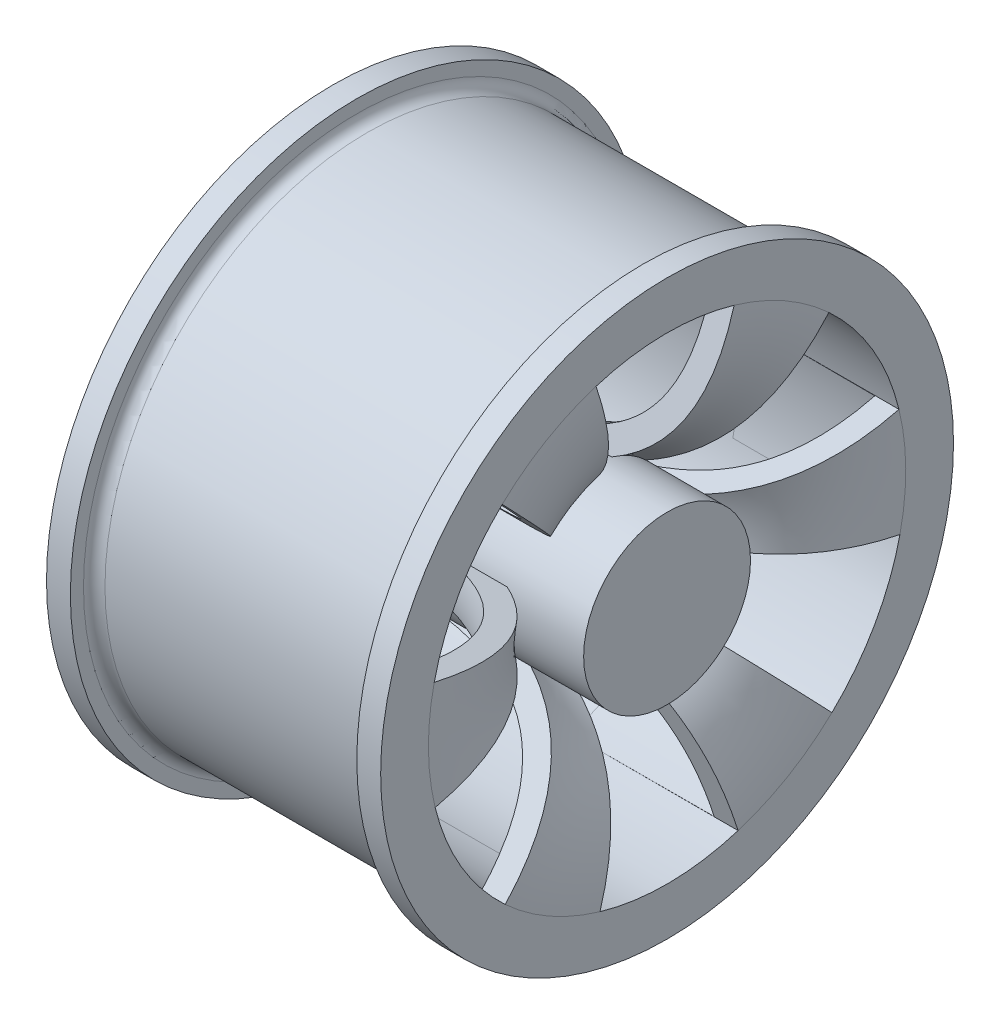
ISO-10303-21;
HEADER;
FILE_DESCRIPTION(('STEP AP214'),'2;1');
FILE_NAME('part.step','',(''),(''),'','','');
FILE_SCHEMA(('AUTOMOTIVE_DESIGN { 1 0 10303 214 1 1 1 1 }'));
ENDSEC;
DATA;
#1=APPLICATION_CONTEXT('core data for automotive mechanical design processes');
#2=APPLICATION_PROTOCOL_DEFINITION('international standard','automotive_design',2000,#1);
#3=PRODUCT_CONTEXT('',#1,'mechanical');
#4=PRODUCT('Part','Part','',(#3));
#5=PRODUCT_RELATED_PRODUCT_CATEGORY('part','',(#4));
#6=PRODUCT_DEFINITION_FORMATION('','',#4);
#7=PRODUCT_DEFINITION_CONTEXT('part definition',#1,'design');
#8=PRODUCT_DEFINITION('design','',#6,#7);
#9=PRODUCT_DEFINITION_SHAPE('','',#8);
#10=(LENGTH_UNIT() NAMED_UNIT(*) SI_UNIT(.MILLI.,.METRE.));
#11=(NAMED_UNIT(*) PLANE_ANGLE_UNIT() SI_UNIT($,.RADIAN.));
#12=(NAMED_UNIT(*) SI_UNIT($,.STERADIAN.) SOLID_ANGLE_UNIT());
#13=UNCERTAINTY_MEASURE_WITH_UNIT(LENGTH_MEASURE(1.E-05),#10,'distance_accuracy_value','');
#14=(GEOMETRIC_REPRESENTATION_CONTEXT(3) GLOBAL_UNCERTAINTY_ASSIGNED_CONTEXT((#13)) GLOBAL_UNIT_ASSIGNED_CONTEXT((#10,
#11,#12)) REPRESENTATION_CONTEXT('',''));
#15=CARTESIAN_POINT('',(0.,0.,0.));
#16=DIRECTION('',(0.,0.,1.));
#17=DIRECTION('',(1.,0.,0.));
#18=AXIS2_PLACEMENT_3D('',#15,#16,#17);
#19=CARTESIAN_POINT('',(2.84491978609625,-11.5374331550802,0.));
#20=CARTESIAN_POINT('',(16.9961886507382,-10.245499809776,0.));
#21=CARTESIAN_POINT('',(16.8449197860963,3.46256684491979,0.));
#22=B_SPLINE_CURVE_WITH_KNOTS('',2,(#19,#20,#21),.UNSPECIFIED.,.F.,.F.,(3,3),(0.,1.),.UNSPECIFIED.);
#23=CARTESIAN_POINT('',(2.84491978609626,-16.5374331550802,0.));
#24=DIRECTION('',(-1.,0.,0.));
#25=AXIS1_PLACEMENT('',#23,#24);
#26=SURFACE_OF_REVOLUTION('',#22,#25);
#27=CARTESIAN_POINT('',(2.84491978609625,-15.3544169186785,-4.85803176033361));
#28=CARTESIAN_POINT('',(16.9961886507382,-15.0487412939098,-6.11328240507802));
#29=CARTESIAN_POINT('',(16.8449197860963,-11.8053682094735,-19.4321270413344));
#30=B_SPLINE_CURVE_WITH_KNOTS('',2,(#27,#28,#29),.UNSPECIFIED.,.F.,.F.,(3,3),(0.,1.),.UNSPECIFIED.);
#31=CARTESIAN_POINT('',(10.2395577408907,-14.8831701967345,-6.79319669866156));
#32=VERTEX_POINT('',#31);
#33=CARTESIAN_POINT('',(16.8449197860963,-11.8053682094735,-19.4321270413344));
#34=VERTEX_POINT('',#33);
#35=EDGE_CURVE('E466',#32,#34,#30,.T.);
#36=ORIENTED_EDGE('',*,*,#35,.F.);
#37=CARTESIAN_POINT('',(10.2395577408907,-16.5374331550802,0.));
#38=DIRECTION('',(-1.,0.,0.));
#39=DIRECTION('',(0.,0.,1.));
#40=AXIS2_PLACEMENT_3D('',#37,#38,#39);
#41=CIRCLE('',#40,6.99171705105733);
#42=CARTESIAN_POINT('',(10.2395577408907,-18.1916961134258,-6.7931966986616));
#43=VERTEX_POINT('',#42);
#44=EDGE_CURVE('E568',#32,#43,#41,.T.);
#45=ORIENTED_EDGE('',*,*,#44,.T.);
#46=CARTESIAN_POINT('',(16.8449197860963,-20.930622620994,-19.5115321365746));
#47=CARTESIAN_POINT('',(16.8483163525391,-20.865462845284,-19.2089596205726));
#48=CARTESIAN_POINT('',(16.8463343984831,-20.8002804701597,-18.9062821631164));
#49=CARTESIAN_POINT('',(16.8304431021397,-20.6698144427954,-18.3004569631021));
#50=CARTESIAN_POINT('',(16.8165031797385,-20.6045309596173,-17.9973100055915));
#51=CARTESIAN_POINT('',(16.7754783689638,-20.4740851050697,-17.3915784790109));
#52=CARTESIAN_POINT('',(16.7483820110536,-20.4089228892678,-17.0889946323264));
#53=CARTESIAN_POINT('',(16.6792410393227,-20.2779685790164,-16.4809020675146));
#54=CARTESIAN_POINT('',(16.6369808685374,-20.2121814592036,-16.1754164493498));
#55=CARTESIAN_POINT('',(16.5362055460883,-20.081206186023,-15.56722654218));
#56=CARTESIAN_POINT('',(16.4777027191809,-20.016017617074,-15.2645203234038));
#57=CARTESIAN_POINT('',(16.3430029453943,-19.8864816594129,-14.6630139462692));
#58=CARTESIAN_POINT('',(16.2668142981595,-19.8221338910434,-14.3642120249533));
#59=CARTESIAN_POINT('',(16.0885361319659,-19.6895361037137,-13.7484878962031));
#60=CARTESIAN_POINT('',(15.9848777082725,-19.6213786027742,-13.4319953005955));
#61=CARTESIAN_POINT('',(15.7536893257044,-19.4868684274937,-12.8073909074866));
#62=CARTESIAN_POINT('',(15.6261588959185,-19.4205157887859,-12.4992792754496));
#63=CARTESIAN_POINT('',(15.3467991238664,-19.2905390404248,-11.8957260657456));
#64=CARTESIAN_POINT('',(15.1951047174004,-19.2269021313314,-11.6002250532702));
#65=CARTESIAN_POINT('',(14.8663562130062,-19.102586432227,-11.0229591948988));
#66=CARTESIAN_POINT('',(14.6893037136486,-19.0419074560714,-10.7411934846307));
#67=CARTESIAN_POINT('',(14.3723539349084,-18.9434453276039,-10.2839799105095));
#68=CARTESIAN_POINT('',(14.2393056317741,-18.9046778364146,-10.1039612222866));
#69=CARTESIAN_POINT('',(13.9621931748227,-18.8289188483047,-9.75217075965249));
#70=CARTESIAN_POINT('',(13.8181280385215,-18.7919275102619,-9.58039972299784));
#71=CARTESIAN_POINT('',(13.5194796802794,-18.71987574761,-9.24582393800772));
#72=CARTESIAN_POINT('',(13.3648960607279,-18.6848153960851,-9.08301952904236));
#73=CARTESIAN_POINT('',(13.0455762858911,-18.6166855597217,-8.76665539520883));
#74=CARTESIAN_POINT('',(12.8808226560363,-18.5836197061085,-8.61311253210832));
#75=CARTESIAN_POINT('',(12.5421900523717,-18.5196338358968,-8.315991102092));
#76=CARTESIAN_POINT('',(12.3683115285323,-18.4887137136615,-8.17241204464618));
#77=CARTESIAN_POINT('',(12.0123547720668,-18.4290783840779,-7.89549255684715));
#78=CARTESIAN_POINT('',(11.8302799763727,-18.4003622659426,-7.76214789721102));
#79=CARTESIAN_POINT('',(11.4196373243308,-18.3393214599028,-7.47870201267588));
#80=CARTESIAN_POINT('',(11.1893499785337,-18.3075094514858,-7.33098143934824));
#81=CARTESIAN_POINT('',(10.7204706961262,-18.2471874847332,-7.0508735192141));
#82=CARTESIAN_POINT('',(10.4819157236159,-18.2186648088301,-6.91842711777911));
#83=CARTESIAN_POINT('',(10.2395577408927,-18.1916961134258,-6.7931966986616));
#84=B_SPLINE_CURVE_WITH_KNOTS('',3,(#46,#47,#48,#49,#50,#51,#52,#53,#54,#55,#56,#57,#58,#59,#60,
#61,#62,#63,#64,#65,#66,#67,#68,#69,#70,#71,#72,#73,#74,#75,#76,#77,#78,#79,#80,#81,#82,#83),
.UNSPECIFIED.,.F.,.F.,(4,2,2,2,2,2,2,2,2,2,2,2,2,2,2,2,2,2,4),(0.,0.928608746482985,
1.85959932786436,2.79140299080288,3.73701434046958,4.6819101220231,5.62636337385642,
6.64530787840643,7.66427248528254,8.67773456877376,9.69113279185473,10.3722920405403,
11.0535121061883,11.7347579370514,12.4172087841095,13.0996260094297,13.7817596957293,
14.6074716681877,15.4298758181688),.UNSPECIFIED.);
#85=CARTESIAN_POINT('',(16.8449197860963,-20.930622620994,-19.5115321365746));
#86=VERTEX_POINT('',#85);
#87=EDGE_CURVE('E414',#86,#43,#84,.T.);
#88=ORIENTED_EDGE('',*,*,#87,.F.);
#89=CARTESIAN_POINT('',(16.8449197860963,-16.5374331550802,0.));
#90=DIRECTION('',(-1.,0.,0.));
#91=DIRECTION('',(0.,0.,1.));
#92=AXIS2_PLACEMENT_3D('',#89,#90,#91);
#93=CIRCLE('',#92,20.);
#94=EDGE_CURVE('E268',#34,#86,#93,.T.);
#95=ORIENTED_EDGE('',*,*,#94,.F.);
#96=EDGE_LOOP('',(#36,#45,#88,#95));
#97=FACE_BOUND('',#96,.T.);
#98=ADVANCED_FACE('F35',(#97),#26,.T.);
#99=CARTESIAN_POINT('',(16.8449197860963,-1.836545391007,-13.5603797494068));
#100=CARTESIAN_POINT('',(16.8483163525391,-2.06600098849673,-13.352663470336));
#101=CARTESIAN_POINT('',(16.8463343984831,-2.29553616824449,-13.1448751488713));
#102=CARTESIAN_POINT('',(16.8304431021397,-2.75496316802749,-12.7289756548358));
#103=CARTESIAN_POINT('',(16.8165031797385,-2.98485439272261,-12.5208650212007));
#104=CARTESIAN_POINT('',(16.7754783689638,-3.44421035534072,-12.1050298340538));
#105=CARTESIAN_POINT('',(16.7483820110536,-3.67367454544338,-11.8973057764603));
#106=CARTESIAN_POINT('',(16.6792410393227,-4.1348209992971,-11.4798497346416));
#107=CARTESIAN_POINT('',(16.6369808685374,-4.36648574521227,-11.2701336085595));
#108=CARTESIAN_POINT('',(16.5362055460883,-4.82770601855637,-10.8526107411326));
#109=CARTESIAN_POINT('',(16.4777027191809,-5.05726300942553,-10.6448026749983));
#110=CARTESIAN_POINT('',(16.3430029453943,-5.51341483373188,-10.2318680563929));
#111=CARTESIAN_POINT('',(16.2668142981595,-5.74001100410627,-10.0267402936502));
#112=CARTESIAN_POINT('',(16.0885361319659,-6.2069448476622,-9.60404517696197));
#113=CARTESIAN_POINT('',(15.9848777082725,-6.44695672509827,-9.3867727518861));
#114=CARTESIAN_POINT('',(15.7536893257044,-6.92062490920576,-8.95798132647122));
#115=CARTESIAN_POINT('',(15.6261588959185,-7.15428109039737,-8.74646243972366));
#116=CARTESIAN_POINT('',(15.3467991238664,-7.61198512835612,-8.33212266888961));
#117=CARTESIAN_POINT('',(15.1951047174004,-7.83607805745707,-8.12926098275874));
#118=CARTESIAN_POINT('',(14.8663562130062,-8.27384710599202,-7.73296750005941));
#119=CARTESIAN_POINT('',(14.6893037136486,-8.48752388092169,-7.53953511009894));
#120=CARTESIAN_POINT('',(14.3723539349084,-8.834251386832,-7.22565761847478));
#121=CARTESIAN_POINT('',(14.2393056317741,-8.97076839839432,-7.10207464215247));
#122=CARTESIAN_POINT('',(13.9621931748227,-9.23754838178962,-6.86057020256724));
#123=CARTESIAN_POINT('',(13.8181280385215,-9.36781079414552,-6.74264924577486));
#124=CARTESIAN_POINT('',(13.5194796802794,-9.62153604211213,-6.51296269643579));
#125=CARTESIAN_POINT('',(13.3648960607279,-9.74499862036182,-6.40119733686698));
#126=CARTESIAN_POINT('',(13.0455762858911,-9.98491307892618,-6.18401310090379));
#127=CARTESIAN_POINT('',(12.8808226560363,-10.1013521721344,-6.07860580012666));
#128=CARTESIAN_POINT('',(12.5421900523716,-10.3266739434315,-5.87463169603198));
#129=CARTESIAN_POINT('',(12.3683115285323,-10.4355569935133,-5.77606455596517));
#130=CARTESIAN_POINT('',(12.0123547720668,-10.6455586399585,-5.58595910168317));
#131=CARTESIAN_POINT('',(11.8302799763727,-10.7466804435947,-5.49441788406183));
#132=CARTESIAN_POINT('',(11.4196373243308,-10.9616313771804,-5.29983205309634));
#133=CARTESIAN_POINT('',(11.1893499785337,-11.0736551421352,-5.19842175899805));
#134=CARTESIAN_POINT('',(10.7204706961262,-11.2860747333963,-5.00612744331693));
#135=CARTESIAN_POINT('',(10.4819157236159,-11.3865153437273,-4.91520288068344));
#136=CARTESIAN_POINT('',(10.2395577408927,-11.4814837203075,-4.82923209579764));
#137=B_SPLINE_CURVE_WITH_KNOTS('',3,(#99,#100,#101,#102,#103,#104,#105,#106,#107,#108,#109,#110,
#111,#112,#113,#114,#115,#116,#117,#118,#119,#120,#121,#122,#123,#124,#125,#126,#127,#128,#129,
#130,#131,#132,#133,#134,#135,#136),.UNSPECIFIED.,.F.,.F.,(4,2,2,2,2,2,2,2,2,2,2,2,2,2,2,2,2,2,
4),(0.,0.928608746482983,1.85959932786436,2.79140299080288,3.73701434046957,4.6819101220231,
5.62636337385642,6.64530787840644,7.66427248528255,8.67773456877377,9.69113279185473,
10.3722920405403,11.0535121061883,11.7347579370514,12.4172087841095,13.0996260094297,
13.7817596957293,14.6074716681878,15.4298758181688),.UNSPECIFIED.);
#138=CARTESIAN_POINT('',(16.8449197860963,-1.836545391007,-13.5603797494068));
#139=VERTEX_POINT('',#138);
#140=CARTESIAN_POINT('',(10.2395577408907,-11.4814837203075,-4.82923209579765));
#141=VERTEX_POINT('',#140);
#142=EDGE_CURVE('E452',#139,#141,#137,.T.);
#143=ORIENTED_EDGE('',*,*,#142,.F.);
#144=CARTESIAN_POINT('',(16.8449197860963,2.65731498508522,-5.6179750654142));
#145=VERTEX_POINT('',#144);
#146=EDGE_CURVE('E45',#145,#139,#93,.T.);
#147=ORIENTED_EDGE('',*,*,#146,.F.);
#148=CARTESIAN_POINT('',(2.84491978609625,-11.7387461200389,-1.40449376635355));
#149=CARTESIAN_POINT('',(16.9961886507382,-10.498829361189,-1.76739623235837));
#150=CARTESIAN_POINT('',(16.8449197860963,2.65731498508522,-5.6179750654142));
#151=B_SPLINE_CURVE_WITH_KNOTS('',2,(#148,#149,#150),.UNSPECIFIED.,.F.,.F.,(3,3),(0.,1.),.UNSPECIFIED.);
#152=CARTESIAN_POINT('',(10.2395577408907,-9.82722076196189,-1.96396460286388));
#153=VERTEX_POINT('',#152);
#154=EDGE_CURVE('E546',#153,#145,#151,.T.);
#155=ORIENTED_EDGE('',*,*,#154,.F.);
#156=EDGE_CURVE('E566',#153,#141,#41,.T.);
#157=ORIENTED_EDGE('',*,*,#156,.T.);
#158=EDGE_LOOP('',(#143,#147,#155,#157));
#159=FACE_BOUND('',#158,.T.);
#160=ADVANCED_FACE('F758',(#159),#26,.T.);
#161=CARTESIAN_POINT('',(2.84491978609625,-20.1531039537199,-3.4535379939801));
#162=CARTESIAN_POINT('',(16.9961886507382,-21.087345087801,-4.34588617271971));
#163=CARTESIAN_POINT('',(16.8449197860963,-31.0001163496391,-13.8141519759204));
#164=B_SPLINE_CURVE_WITH_KNOTS('',2,(#161,#162,#163),.UNSPECIFIED.,.F.,.F.,(3,3),(0.,1.),.UNSPECIFIED.);
#165=CARTESIAN_POINT('',(10.2395577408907,-21.5933825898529,-4.82923209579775));
#166=VERTEX_POINT('',#165);
#167=CARTESIAN_POINT('',(16.8449197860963,-31.000116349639,-13.8141519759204));
#168=VERTEX_POINT('',#167);
#169=EDGE_CURVE('E428',#166,#168,#164,.T.);
#170=ORIENTED_EDGE('',*,*,#169,.F.);
#171=CARTESIAN_POINT('',(10.2395577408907,-23.2476455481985,-1.96396460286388));
#172=VERTEX_POINT('',#171);
#173=EDGE_CURVE('E262',#166,#172,#41,.T.);
#174=ORIENTED_EDGE('',*,*,#173,.T.);
#175=CARTESIAN_POINT('',(16.8449197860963,-35.6315103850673,-5.95115238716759));
#176=CARTESIAN_POINT('',(16.8483163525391,-35.3368950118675,-5.85629615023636));
#177=CARTESIAN_POINT('',(16.8463343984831,-35.0421774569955,-5.7614070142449));
#178=CARTESIAN_POINT('',(16.8304431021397,-34.4522844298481,-5.57148130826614));
#179=CARTESIAN_POINT('',(16.8165031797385,-34.1571097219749,-5.4764449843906));
#180=CARTESIAN_POINT('',(16.7754783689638,-33.5673079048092,-5.28654864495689));
#181=CARTESIAN_POINT('',(16.7483820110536,-33.2726814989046,-5.19168885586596));
#182=CARTESIAN_POINT('',(16.6792410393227,-32.6805807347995,-5.00105233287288));
#183=CARTESIAN_POINT('',(16.6369808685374,-32.3831288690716,-4.90528284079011));
#184=CARTESIAN_POINT('',(16.5362055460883,-31.7909333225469,-4.71461580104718));
#185=CARTESIAN_POINT('',(16.4777027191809,-31.4961877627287,-4.61971764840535));
#186=CARTESIAN_POINT('',(16.3430029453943,-30.9104999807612,-4.43114588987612));
#187=CARTESIAN_POINT('',(16.2668142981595,-30.6195560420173,-4.33747173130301));
#188=CARTESIAN_POINT('',(16.0885361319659,-30.0200244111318,-4.14444271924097));
#189=CARTESIAN_POINT('',(15.9848777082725,-29.7118550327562,-4.04522254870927));
#190=CARTESIAN_POINT('',(15.7536893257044,-29.1036766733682,-3.84940958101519));
#191=CARTESIAN_POINT('',(15.6261588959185,-28.8036678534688,-3.75281683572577));
#192=CARTESIAN_POINT('',(15.3467991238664,-28.2159870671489,-3.56360339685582));
#193=CARTESIAN_POINT('',(15.1951047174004,-27.9282572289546,-3.47096407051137));
#194=CARTESIAN_POINT('',(14.8663562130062,-27.3661724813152,-3.28999169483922));
#195=CARTESIAN_POINT('',(14.6893037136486,-27.0918167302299,-3.20165837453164));
#196=CARTESIAN_POINT('',(14.3723539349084,-26.6466270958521,-3.05832229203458));
#197=CARTESIAN_POINT('',(14.2393056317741,-26.4713425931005,-3.00188658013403));
#198=CARTESIAN_POINT('',(13.9621931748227,-26.1288036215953,-2.89160055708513));
#199=CARTESIAN_POINT('',(13.8181280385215,-25.9615498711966,-2.83775047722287));
#200=CARTESIAN_POINT('',(13.5194796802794,-25.6357728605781,-2.73286124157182));
#201=CARTESIAN_POINT('',(13.3648960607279,-25.4772499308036,-2.68182219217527));
#202=CARTESIAN_POINT('',(13.0455762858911,-25.1692056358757,-2.58264229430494));
#203=CARTESIAN_POINT('',(12.8808226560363,-25.0197006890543,-2.53450673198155));
#204=CARTESIAN_POINT('',(12.5421900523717,-24.7303930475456,-2.44135940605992));
#205=CARTESIAN_POINT('',(12.3683115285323,-24.5905898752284,-2.39634748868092));
#206=CARTESIAN_POINT('',(12.0123547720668,-24.3209528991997,-2.30953345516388));
#207=CARTESIAN_POINT('',(11.8302799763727,-24.1911149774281,-2.2677300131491));
#208=CARTESIAN_POINT('',(11.4196373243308,-23.9151232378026,-2.17886995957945));
#209=CARTESIAN_POINT('',(11.1893499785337,-23.7712874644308,-2.1325596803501));
#210=CARTESIAN_POINT('',(10.7204706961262,-23.4985459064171,-2.04474607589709));
#211=CARTESIAN_POINT('',(10.4819157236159,-23.369582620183,-2.00322423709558));
#212=CARTESIAN_POINT('',(10.2395577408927,-23.2476455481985,-1.96396460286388));
#213=B_SPLINE_CURVE_WITH_KNOTS('',3,(#175,#176,#177,#178,#179,#180,#181,#182,#183,#184,#185,
#186,#187,#188,#189,#190,#191,#192,#193,#194,#195,#196,#197,#198,#199,#200,#201,#202,#203,#204,
#205,#206,#207,#208,#209,#210,#211,#212),.UNSPECIFIED.,.F.,.F.,(4,2,2,2,2,2,2,2,2,2,2,2,2,2,2,2,
2,2,4),(0.,0.928608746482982,1.85959932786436,2.79140299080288,3.73701434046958,4.6819101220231,
5.62636337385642,6.64530787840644,7.66427248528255,8.67773456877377,9.69113279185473,
10.3722920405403,11.0535121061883,11.7347579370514,12.4172087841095,13.0996260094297,
13.7817596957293,14.6074716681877,15.4298758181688),.UNSPECIFIED.);
#214=CARTESIAN_POINT('',(16.8449197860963,-35.6315103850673,-5.95115238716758));
#215=VERTEX_POINT('',#214);
#216=EDGE_CURVE('E249',#215,#172,#213,.T.);
#217=ORIENTED_EDGE('',*,*,#216,.F.);
#218=EDGE_CURVE('E244',#168,#215,#93,.T.);
#219=ORIENTED_EDGE('',*,*,#218,.F.);
#220=EDGE_LOOP('',(#170,#174,#217,#219));
#221=FACE_BOUND('',#220,.T.);
#222=ADVANCED_FACE('F259',(#221),#26,.T.);
#223=CARTESIAN_POINT('',(2.84491978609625,-17.7204493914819,4.85803176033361));
#224=CARTESIAN_POINT('',(16.9961886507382,-18.0261250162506,6.11328240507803));
#225=CARTESIAN_POINT('',(16.8449197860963,-21.2694981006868,19.4321270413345));
#226=B_SPLINE_CURVE_WITH_KNOTS('',2,(#223,#224,#225),.UNSPECIFIED.,.F.,.F.,(3,3),(0.,1.),.UNSPECIFIED.);
#227=CARTESIAN_POINT('',(10.2395577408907,-18.1916961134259,6.79319669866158));
#228=VERTEX_POINT('',#227);
#229=CARTESIAN_POINT('',(16.8449197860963,-21.2694981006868,19.4321270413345));
#230=VERTEX_POINT('',#229);
#231=EDGE_CURVE('E396',#228,#230,#226,.T.);
#232=ORIENTED_EDGE('',*,*,#231,.F.);
#233=CARTESIAN_POINT('',(10.2395577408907,-14.8831701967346,6.79319669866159));
#234=VERTEX_POINT('',#233);
#235=EDGE_CURVE('E569',#228,#234,#41,.T.);
#236=ORIENTED_EDGE('',*,*,#235,.T.);
#237=CARTESIAN_POINT('',(16.8449197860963,-12.1442436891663,19.5115321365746));
#238=CARTESIAN_POINT('',(16.8483163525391,-12.2094034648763,19.2089596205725));
#239=CARTESIAN_POINT('',(16.8463343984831,-12.2745858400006,18.9062821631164));
#240=CARTESIAN_POINT('',(16.8304431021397,-12.4050518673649,18.3004569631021));
#241=CARTESIAN_POINT('',(16.8165031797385,-12.4703353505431,17.9973100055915));
#242=CARTESIAN_POINT('',(16.7754783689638,-12.6007812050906,17.3915784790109));
#243=CARTESIAN_POINT('',(16.7483820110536,-12.6659434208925,17.0889946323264));
#244=CARTESIAN_POINT('',(16.6792410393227,-12.796897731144,16.4809020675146));
#245=CARTESIAN_POINT('',(16.6369808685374,-12.8626848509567,16.1754164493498));
#246=CARTESIAN_POINT('',(16.5362055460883,-12.9936601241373,15.5672265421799));
#247=CARTESIAN_POINT('',(16.4777027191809,-13.0588486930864,15.2645203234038));
#248=CARTESIAN_POINT('',(16.3430029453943,-13.1883846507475,14.6630139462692));
#249=CARTESIAN_POINT('',(16.2668142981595,-13.252732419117,14.3642120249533));
#250=CARTESIAN_POINT('',(16.0885361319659,-13.3853302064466,13.7484878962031));
#251=CARTESIAN_POINT('',(15.9848777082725,-13.4534877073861,13.4319953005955));
#252=CARTESIAN_POINT('',(15.7536893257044,-13.5879978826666,12.8073909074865));
#253=CARTESIAN_POINT('',(15.6261588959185,-13.6543505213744,12.4992792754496));
#254=CARTESIAN_POINT('',(15.3467991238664,-13.7843272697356,11.8957260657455));
#255=CARTESIAN_POINT('',(15.1951047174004,-13.847964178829,11.6002250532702));
#256=CARTESIAN_POINT('',(14.8663562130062,-13.9722798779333,11.0229591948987));
#257=CARTESIAN_POINT('',(14.6893037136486,-14.032958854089,10.7411934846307));
#258=CARTESIAN_POINT('',(14.3723539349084,-14.1314209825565,10.2839799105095));
#259=CARTESIAN_POINT('',(14.2393056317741,-14.1701884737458,10.1039612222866));
#260=CARTESIAN_POINT('',(13.9621931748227,-14.2459474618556,9.75217075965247));
#261=CARTESIAN_POINT('',(13.8181280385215,-14.2829387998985,9.58039972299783));
#262=CARTESIAN_POINT('',(13.5194796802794,-14.3549905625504,9.2458239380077));
#263=CARTESIAN_POINT('',(13.3648960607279,-14.3900509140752,9.08301952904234));
#264=CARTESIAN_POINT('',(13.0455762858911,-14.4581807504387,8.76665539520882));
#265=CARTESIAN_POINT('',(12.8808226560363,-14.4912466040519,8.6131125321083));
#266=CARTESIAN_POINT('',(12.5421900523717,-14.5552324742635,8.31599110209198));
#267=CARTESIAN_POINT('',(12.3683115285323,-14.5861525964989,8.17241204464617));
#268=CARTESIAN_POINT('',(12.0123547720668,-14.6457879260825,7.89549255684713));
#269=CARTESIAN_POINT('',(11.8302799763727,-14.6745040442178,7.76214789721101));
#270=CARTESIAN_POINT('',(11.4196373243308,-14.7355448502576,7.47870201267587));
#271=CARTESIAN_POINT('',(11.1893499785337,-14.7673568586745,7.33098143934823));
#272=CARTESIAN_POINT('',(10.7204706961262,-14.8276788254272,7.05087351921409));
#273=CARTESIAN_POINT('',(10.4819157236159,-14.8562015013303,6.9184271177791));
#274=CARTESIAN_POINT('',(10.2395577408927,-14.8831701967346,6.79319669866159));
#275=B_SPLINE_CURVE_WITH_KNOTS('',3,(#237,#238,#239,#240,#241,#242,#243,#244,#245,#246,#247,
#248,#249,#250,#251,#252,#253,#254,#255,#256,#257,#258,#259,#260,#261,#262,#263,#264,#265,#266,
#267,#268,#269,#270,#271,#272,#273,#274),.UNSPECIFIED.,.F.,.F.,(4,2,2,2,2,2,2,2,2,2,2,2,2,2,2,2,
2,2,4),(0.,0.928608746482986,1.85959932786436,2.79140299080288,3.73701434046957,4.6819101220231,
5.62636337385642,6.64530787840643,7.66427248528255,8.67773456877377,9.69113279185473,
10.3722920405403,11.0535121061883,11.7347579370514,12.4172087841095,13.0996260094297,
13.7817596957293,14.6074716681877,15.4298758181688),.UNSPECIFIED.);
#276=CARTESIAN_POINT('',(16.8449197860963,-12.1442436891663,19.5115321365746));
#277=VERTEX_POINT('',#276);
#278=EDGE_CURVE('E492',#277,#234,#275,.T.);
#279=ORIENTED_EDGE('',*,*,#278,.F.);
#280=EDGE_CURVE('E46',#230,#277,#93,.T.);
#281=ORIENTED_EDGE('',*,*,#280,.F.);
#282=EDGE_LOOP('',(#232,#236,#279,#281));
#283=FACE_BOUND('',#282,.T.);
#284=ADVANCED_FACE('F686',(#283),#26,.T.);
#285=CARTESIAN_POINT('',(16.8449197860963,-31.2383209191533,13.5603797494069));
#286=CARTESIAN_POINT('',(16.8483163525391,-31.0088653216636,13.3526634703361));
#287=CARTESIAN_POINT('',(16.8463343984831,-30.7793301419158,13.1448751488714));
#288=CARTESIAN_POINT('',(16.8304431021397,-30.3199031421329,12.7289756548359));
#289=CARTESIAN_POINT('',(16.8165031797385,-30.0900119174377,12.5208650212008));
#290=CARTESIAN_POINT('',(16.7754783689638,-29.6306559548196,12.1050298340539));
#291=CARTESIAN_POINT('',(16.7483820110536,-29.401191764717,11.8973057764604));
#292=CARTESIAN_POINT('',(16.6792410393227,-28.9400453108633,11.4798497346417));
#293=CARTESIAN_POINT('',(16.6369808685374,-28.7083805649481,11.2701336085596));
#294=CARTESIAN_POINT('',(16.5362055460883,-28.247160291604,10.8526107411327));
#295=CARTESIAN_POINT('',(16.4777027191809,-28.0176033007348,10.6448026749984));
#296=CARTESIAN_POINT('',(16.3430029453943,-27.5614514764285,10.231868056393));
#297=CARTESIAN_POINT('',(16.2668142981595,-27.3348553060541,10.0267402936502));
#298=CARTESIAN_POINT('',(16.0885361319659,-26.8679214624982,9.60404517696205));
#299=CARTESIAN_POINT('',(15.9848777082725,-26.6279095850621,9.38677275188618));
#300=CARTESIAN_POINT('',(15.7536893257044,-26.1542414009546,8.95798132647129));
#301=CARTESIAN_POINT('',(15.6261588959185,-25.920585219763,8.74646243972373));
#302=CARTESIAN_POINT('',(15.3467991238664,-25.4628811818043,8.33212266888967));
#303=CARTESIAN_POINT('',(15.1951047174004,-25.2387882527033,8.1292609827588));
#304=CARTESIAN_POINT('',(14.8663562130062,-24.8010192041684,7.73296750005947));
#305=CARTESIAN_POINT('',(14.6893037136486,-24.5873424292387,7.539535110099));
#306=CARTESIAN_POINT('',(14.3723539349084,-24.2406149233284,7.22565761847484));
#307=CARTESIAN_POINT('',(14.2393056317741,-24.1040979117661,7.10207464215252));
#308=CARTESIAN_POINT('',(13.9621931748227,-23.8373179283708,6.8605702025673));
#309=CARTESIAN_POINT('',(13.8181280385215,-23.7070555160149,6.74264924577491));
#310=CARTESIAN_POINT('',(13.5194796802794,-23.4533302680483,6.51296269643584));
#311=CARTESIAN_POINT('',(13.3648960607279,-23.3298676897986,6.40119733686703));
#312=CARTESIAN_POINT('',(13.0455762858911,-23.0899532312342,6.18401310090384));
#313=CARTESIAN_POINT('',(12.8808226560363,-22.973514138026,6.07860580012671));
#314=CARTESIAN_POINT('',(12.5421900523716,-22.7481923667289,5.87463169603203));
#315=CARTESIAN_POINT('',(12.3683115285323,-22.6393093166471,5.77606455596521));
#316=CARTESIAN_POINT('',(12.0123547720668,-22.4293076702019,5.58595910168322));
#317=CARTESIAN_POINT('',(11.8302799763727,-22.3281858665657,5.49441788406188));
#318=CARTESIAN_POINT('',(11.4196373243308,-22.11323493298,5.29983205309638));
#319=CARTESIAN_POINT('',(11.1893499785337,-22.0012111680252,5.1984217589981));
#320=CARTESIAN_POINT('',(10.7204706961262,-21.7887915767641,5.00612744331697));
#321=CARTESIAN_POINT('',(10.4819157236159,-21.6883509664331,4.91520288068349));
#322=CARTESIAN_POINT('',(10.2395577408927,-21.5933825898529,4.82923209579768));
#323=B_SPLINE_CURVE_WITH_KNOTS('',3,(#285,#286,#287,#288,#289,#290,#291,#292,#293,#294,#295,
#296,#297,#298,#299,#300,#301,#302,#303,#304,#305,#306,#307,#308,#309,#310,#311,#312,#313,#314,
#315,#316,#317,#318,#319,#320,#321,#322),.UNSPECIFIED.,.F.,.F.,(4,2,2,2,2,2,2,2,2,2,2,2,2,2,2,2,
2,2,4),(0.,0.928608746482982,1.85959932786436,2.79140299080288,3.73701434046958,4.6819101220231,
5.62636337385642,6.64530787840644,7.66427248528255,8.67773456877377,9.69113279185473,
10.3722920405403,11.0535121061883,11.7347579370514,12.4172087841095,13.0996260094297,
13.7817596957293,14.6074716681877,15.4298758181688),.UNSPECIFIED.);
#324=CARTESIAN_POINT('',(16.8449197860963,-31.2383209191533,13.5603797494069));
#325=VERTEX_POINT('',#324);
#326=CARTESIAN_POINT('',(10.2395577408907,-21.5933825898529,4.82923209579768));
#327=VERTEX_POINT('',#326);
#328=EDGE_CURVE('E667',#325,#327,#323,.T.);
#329=ORIENTED_EDGE('',*,*,#328,.F.);
#330=CARTESIAN_POINT('',(16.8449197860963,-35.7321812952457,5.6179750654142));
#331=VERTEX_POINT('',#330);
#332=EDGE_CURVE('E245',#331,#325,#93,.T.);
#333=ORIENTED_EDGE('',*,*,#332,.F.);
#334=CARTESIAN_POINT('',(2.84491978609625,-21.3361201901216,1.40449376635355));
#335=CARTESIAN_POINT('',(16.9961886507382,-22.5760369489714,1.76739623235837));
#336=CARTESIAN_POINT('',(16.8449197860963,-35.7321812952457,5.6179750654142));
#337=B_SPLINE_CURVE_WITH_KNOTS('',2,(#334,#335,#336),.UNSPECIFIED.,.F.,.F.,(3,3),(0.,1.),.UNSPECIFIED.);
#338=CARTESIAN_POINT('',(10.2395577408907,-23.2476455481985,1.96396460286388));
#339=VERTEX_POINT('',#338);
#340=EDGE_CURVE('E693',#339,#331,#337,.T.);
#341=ORIENTED_EDGE('',*,*,#340,.F.);
#342=EDGE_CURVE('E575',#339,#327,#41,.T.);
#343=ORIENTED_EDGE('',*,*,#342,.T.);
#344=EDGE_LOOP('',(#329,#333,#341,#343));
#345=FACE_BOUND('',#344,.T.);
#346=ADVANCED_FACE('F691',(#345),#26,.T.);
#347=CARTESIAN_POINT('',(2.84491978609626,-16.5374331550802,0.));
#348=DIRECTION('',(-1.,0.,0.));
#349=DIRECTION('',(0.,0.,1.));
#350=AXIS2_PLACEMENT_3D('',#347,#348,#349);
#351=CONICAL_SURFACE('',#350,20.,0.00183903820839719);
#352=DIRECTION('',(-0.999998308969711,0.000435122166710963,-0.0017868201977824));
#353=VECTOR('',#352,1.);
#354=CARTESIAN_POINT('',(10878.08250952,-16.5374331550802,0.));
#355=LINE('',#354,#353);
#356=CARTESIAN_POINT('',(2.84491978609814,-11.8053682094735,-19.4321270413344));
#357=VERTEX_POINT('',#356);
#358=CARTESIAN_POINT('',(14.8450415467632,-11.8105897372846,-19.4106849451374));
#359=VERTEX_POINT('',#358);
#360=EDGE_CURVE('E461',#357,#359,#355,.F.);
#361=ORIENTED_EDGE('',*,*,#360,.F.);
#362=CARTESIAN_POINT('',(2.84491978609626,-16.5374331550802,0.));
#363=DIRECTION('',(-1.,0.,0.));
#364=DIRECTION('',(0.,0.,1.));
#365=AXIS2_PLACEMENT_3D('',#362,#363,#364);
#366=CIRCLE('',#365,20.);
#367=CARTESIAN_POINT('',(2.84491978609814,-20.930622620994,-19.5115321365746));
#368=VERTEX_POINT('',#367);
#369=EDGE_CURVE('E310',#357,#368,#366,.T.);
#370=ORIENTED_EDGE('',*,*,#369,.T.);
#371=CARTESIAN_POINT('',(14.8452415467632,-20.9259762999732,-19.4899567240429));
#372=CARTESIAN_POINT('',(12.845154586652,-20.9267506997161,-19.4935526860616));
#373=CARTESIAN_POINT('',(10.8450676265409,-20.927525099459,-19.4971486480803));
#374=CARTESIAN_POINT('',(6.84489370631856,-20.9290738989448,-19.5043405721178));
#375=CARTESIAN_POINT('',(4.84480674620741,-20.9298482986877,-19.5079365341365));
#376=CARTESIAN_POINT('',(2.84471978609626,-20.9306226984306,-19.5115324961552));
#377=B_SPLINE_CURVE_WITH_KNOTS('',3,(#371,#372,#373,#374,#375,#376),.UNSPECIFIED.,.F.,.F.,(4,2,
4),(0.,6.00027102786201,12.000542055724),.UNSPECIFIED.);
#378=CARTESIAN_POINT('',(14.8450415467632,-20.9259763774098,-19.4899570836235));
#379=VERTEX_POINT('',#378);
#380=EDGE_CURVE('E395',#379,#368,#377,.T.);
#381=ORIENTED_EDGE('',*,*,#380,.F.);
#382=CARTESIAN_POINT('',(14.8450415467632,-16.5374331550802,0.));
#383=DIRECTION('',(-1.,0.,0.));
#384=DIRECTION('',(0.,0.,1.));
#385=AXIS2_PLACEMENT_3D('',#382,#383,#384);
#386=CIRCLE('',#385,19.9779312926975);
#387=EDGE_CURVE('E316',#359,#379,#386,.T.);
#388=ORIENTED_EDGE('',*,*,#387,.F.);
#389=EDGE_LOOP('',(#361,#370,#381,#388));
#390=FACE_BOUND('',#389,.T.);
#391=ADVANCED_FACE('F781',(#390),#351,.F.);
#392=CARTESIAN_POINT('',(14.8452415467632,-1.85290708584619,-13.5455682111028));
#393=CARTESIAN_POINT('',(12.845154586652,-1.85018009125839,-13.5480368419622));
#394=CARTESIAN_POINT('',(10.8450676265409,-1.8474530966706,-13.5505054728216));
#395=CARTESIAN_POINT('',(6.84489370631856,-1.841999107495,-13.5554427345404));
#396=CARTESIAN_POINT('',(4.84480674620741,-1.83927211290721,-13.5579113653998));
#397=CARTESIAN_POINT('',(2.84471978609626,-1.83654511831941,-13.5603799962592));
#398=B_SPLINE_CURVE_WITH_KNOTS('',3,(#392,#393,#394,#395,#396,#397),.UNSPECIFIED.,.F.,.F.,(4,2,
4),(0.,6.00027102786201,12.000542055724),.UNSPECIFIED.);
#399=CARTESIAN_POINT('',(14.8450415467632,-1.85290681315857,-13.5455684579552));
#400=VERTEX_POINT('',#399);
#401=CARTESIAN_POINT('',(2.84491978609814,-1.836545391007,-13.5603797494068));
#402=VERTEX_POINT('',#401);
#403=EDGE_CURVE('E440',#400,#402,#398,.T.);
#404=ORIENTED_EDGE('',*,*,#403,.F.);
#405=CARTESIAN_POINT('',(14.8450415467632,2.63613482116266,-5.61177599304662));
#406=VERTEX_POINT('',#405);
#407=EDGE_CURVE('E313',#406,#400,#386,.T.);
#408=ORIENTED_EDGE('',*,*,#407,.F.);
#409=DIRECTION('',(-0.999998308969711,0.00176499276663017,-0.0005165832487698));
#410=VECTOR('',#409,1.);
#411=CARTESIAN_POINT('',(10878.08250952,-16.5374331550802,0.));
#412=LINE('',#411,#410);
#413=CARTESIAN_POINT('',(2.84491978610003,2.65731498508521,-5.6179750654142));
#414=VERTEX_POINT('',#413);
#415=EDGE_CURVE('E541',#414,#406,#412,.F.);
#416=ORIENTED_EDGE('',*,*,#415,.F.);
#417=EDGE_CURVE('E307',#414,#402,#366,.T.);
#418=ORIENTED_EDGE('',*,*,#417,.T.);
#419=EDGE_LOOP('',(#404,#408,#416,#418));
#420=FACE_BOUND('',#419,.T.);
#421=ADVANCED_FACE('F797',(#420),#351,.F.);
#422=DIRECTION('',(-0.999998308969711,-0.00132987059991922,-0.00127023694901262));
#423=VECTOR('',#422,1.);
#424=CARTESIAN_POINT('',(10878.08250952,-16.5374331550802,0.));
#425=LINE('',#424,#423);
#426=CARTESIAN_POINT('',(2.84491978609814,-31.000116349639,-13.8141519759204));
#427=VERTEX_POINT('',#426);
#428=CARTESIAN_POINT('',(14.8450415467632,-30.9841577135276,-13.7989089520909));
#429=VERTEX_POINT('',#428);
#430=EDGE_CURVE('E423',#427,#429,#425,.F.);
#431=ORIENTED_EDGE('',*,*,#430,.F.);
#432=CARTESIAN_POINT('',(2.84491978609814,-35.6315103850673,-5.95115238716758));
#433=VERTEX_POINT('',#432);
#434=EDGE_CURVE('E610',#427,#433,#366,.T.);
#435=ORIENTED_EDGE('',*,*,#434,.T.);
#436=CARTESIAN_POINT('',(14.8452415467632,-35.6105023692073,-5.94438851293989));
#437=CARTESIAN_POINT('',(12.845154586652,-35.614003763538,-5.94551584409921));
#438=CARTESIAN_POINT('',(10.8450676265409,-35.6175051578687,-5.94664317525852));
#439=CARTESIAN_POINT('',(6.84489370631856,-35.6245079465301,-5.94889783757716));
#440=CARTESIAN_POINT('',(4.84480674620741,-35.6280093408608,-5.95002516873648));
#441=CARTESIAN_POINT('',(2.84471978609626,-35.6315107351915,-5.9511524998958));
#442=B_SPLINE_CURVE_WITH_KNOTS('',3,(#436,#437,#438,#439,#440,#441),.UNSPECIFIED.,.F.,.F.,(4,2,
4),(0.,6.00027102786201,12.000542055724),.UNSPECIFIED.);
#443=CARTESIAN_POINT('',(14.8450415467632,-35.6105027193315,-5.94438862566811));
#444=VERTEX_POINT('',#443);
#445=EDGE_CURVE('E252',#444,#433,#442,.T.);
#446=ORIENTED_EDGE('',*,*,#445,.F.);
#447=EDGE_CURVE('E712',#429,#444,#386,.T.);
#448=ORIENTED_EDGE('',*,*,#447,.F.);
#449=EDGE_LOOP('',(#431,#435,#446,#448));
#450=FACE_BOUND('',#449,.T.);
#451=ADVANCED_FACE('F725',(#450),#351,.F.);
#452=DIRECTION('',(-0.999998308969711,-0.000435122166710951,0.00178682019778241));
#453=VECTOR('',#452,1.);
#454=CARTESIAN_POINT('',(10878.08250952,-16.5374331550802,0.));
#455=LINE('',#454,#453);
#456=CARTESIAN_POINT('',(2.84491978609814,-21.2694981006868,19.4321270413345));
#457=VERTEX_POINT('',#456);
#458=CARTESIAN_POINT('',(14.8450415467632,-21.2642765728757,19.4106849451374));
#459=VERTEX_POINT('',#458);
#460=EDGE_CURVE('E675',#457,#459,#455,.F.);
#461=ORIENTED_EDGE('',*,*,#460,.F.);
#462=CARTESIAN_POINT('',(2.84491978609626,-12.1442436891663,19.5115321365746));
#463=VERTEX_POINT('',#462);
#464=EDGE_CURVE('E311',#457,#463,#366,.T.);
#465=ORIENTED_EDGE('',*,*,#464,.T.);
#466=CARTESIAN_POINT('',(14.8452415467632,-12.1488900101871,19.4899567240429));
#467=CARTESIAN_POINT('',(12.845154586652,-12.1481156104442,19.4935526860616));
#468=CARTESIAN_POINT('',(10.8450676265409,-12.1473412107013,19.4971486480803));
#469=CARTESIAN_POINT('',(6.84489370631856,-12.1457924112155,19.5043405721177));
#470=CARTESIAN_POINT('',(4.84480674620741,-12.1450180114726,19.5079365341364));
#471=CARTESIAN_POINT('',(2.84471978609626,-12.1442436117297,19.5115324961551));
#472=B_SPLINE_CURVE_WITH_KNOTS('',3,(#466,#467,#468,#469,#470,#471),.UNSPECIFIED.,.F.,.F.,(4,2,
4),(0.,6.00027102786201,12.000542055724),.UNSPECIFIED.);
#473=CARTESIAN_POINT('',(14.8450415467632,-12.1488899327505,19.4899570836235));
#474=VERTEX_POINT('',#473);
#475=EDGE_CURVE('E487',#474,#463,#472,.T.);
#476=ORIENTED_EDGE('',*,*,#475,.F.);
#477=EDGE_CURVE('E317',#459,#474,#386,.T.);
#478=ORIENTED_EDGE('',*,*,#477,.F.);
#479=EDGE_LOOP('',(#461,#465,#476,#478));
#480=FACE_BOUND('',#479,.T.);
#481=ADVANCED_FACE('F789',(#480),#351,.F.);
#482=CARTESIAN_POINT('',(14.8452415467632,-31.2219592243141,13.5455682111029));
#483=CARTESIAN_POINT('',(12.845154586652,-31.2246862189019,13.5480368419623));
#484=CARTESIAN_POINT('',(10.8450676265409,-31.2274132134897,13.5505054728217));
#485=CARTESIAN_POINT('',(6.84489370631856,-31.2328672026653,13.5554427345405));
#486=CARTESIAN_POINT('',(4.84480674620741,-31.2355941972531,13.5579113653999));
#487=CARTESIAN_POINT('',(2.84471978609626,-31.2383211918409,13.5603799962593));
#488=B_SPLINE_CURVE_WITH_KNOTS('',3,(#482,#483,#484,#485,#486,#487),.UNSPECIFIED.,.F.,.F.,(4,2,
4),(0.,6.00027102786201,12.000542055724),.UNSPECIFIED.);
#489=CARTESIAN_POINT('',(14.8450415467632,-31.2219594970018,13.5455684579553));
#490=VERTEX_POINT('',#489);
#491=CARTESIAN_POINT('',(2.84491978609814,-31.2383209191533,13.5603797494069));
#492=VERTEX_POINT('',#491);
#493=EDGE_CURVE('E622',#490,#492,#488,.T.);
#494=ORIENTED_EDGE('',*,*,#493,.F.);
#495=CARTESIAN_POINT('',(14.8450415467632,-35.7110011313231,5.61177599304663));
#496=VERTEX_POINT('',#495);
#497=EDGE_CURVE('E711',#496,#490,#386,.T.);
#498=ORIENTED_EDGE('',*,*,#497,.F.);
#499=DIRECTION('',(-0.999998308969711,-0.00176499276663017,0.0005165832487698));
#500=VECTOR('',#499,1.);
#501=CARTESIAN_POINT('',(10878.08250952,-16.5374331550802,0.));
#502=LINE('',#501,#500);
#503=CARTESIAN_POINT('',(2.84491978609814,-35.7321812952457,5.6179750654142));
#504=VERTEX_POINT('',#503);
#505=EDGE_CURVE('E624',#504,#496,#502,.F.);
#506=ORIENTED_EDGE('',*,*,#505,.F.);
#507=EDGE_CURVE('E608',#504,#492,#366,.T.);
#508=ORIENTED_EDGE('',*,*,#507,.T.);
#509=EDGE_LOOP('',(#494,#498,#506,#508));
#510=FACE_BOUND('',#509,.T.);
#511=ADVANCED_FACE('F620',(#510),#351,.F.);
#512=CARTESIAN_POINT('',(14.8450415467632,3.44049813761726,0.));
#513=CARTESIAN_POINT('',(14.8506640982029,2.93097947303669,0.));
#514=CARTESIAN_POINT('',(14.8280765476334,1.88505713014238,0.));
#515=CARTESIAN_POINT('',(14.6482790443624,0.0105365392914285,0.));
#516=CARTESIAN_POINT('',(14.1822345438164,-2.0740929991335,0.));
#517=CARTESIAN_POINT('',(13.2701119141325,-4.13618782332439,0.));
#518=CARTESIAN_POINT('',(12.0205171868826,-5.82801017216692,0.));
#519=CARTESIAN_POINT('',(10.398481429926,-7.21275137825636,0.));
#520=CARTESIAN_POINT('',(8.34175992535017,-8.31809330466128,0.));
#521=CARTESIAN_POINT('',(6.21394855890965,-8.99200022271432,0.));
#522=CARTESIAN_POINT('',(4.27927403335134,-9.36482982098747,0.));
#523=CARTESIAN_POINT('',(3.19371127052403,-9.49727300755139,0.));
#524=CARTESIAN_POINT('',(2.6630869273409,-9.54571610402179,0.));
#525=B_SPLINE_CURVE_WITH_KNOTS('',3,(#512,#513,#514,#515,#516,#517,#518,#519,#520,#521,#522,
#523,#524),.UNSPECIFIED.,.F.,.F.,(4,1,1,1,1,1,1,1,1,1,4),(0.,0.0625,0.125,0.25,0.375,0.5,0.625,
0.75,0.875,0.9375,1.),.UNSPECIFIED.);
#526=CARTESIAN_POINT('',(2.84491978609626,-16.5374331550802,0.));
#527=DIRECTION('',(-1.,0.,0.));
#528=AXIS1_PLACEMENT('',#526,#527);
#529=SURFACE_OF_REVOLUTION('',#525,#528);
#530=CARTESIAN_POINT('',(14.8450415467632,-11.8105897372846,-19.4106849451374));
#531=CARTESIAN_POINT('',(14.8506640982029,-11.9311435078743,-18.9156333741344));
#532=CARTESIAN_POINT('',(14.8280765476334,-12.1786121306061,-17.8994085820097));
#533=CARTESIAN_POINT('',(14.6482790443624,-12.6221297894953,-16.0781124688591));
#534=CARTESIAN_POINT('',(14.1822345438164,-13.1153599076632,-14.0526731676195));
#535=CARTESIAN_POINT('',(13.2701119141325,-13.6032582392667,-12.0491287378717));
#536=CARTESIAN_POINT('',(12.0205171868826,-14.0035489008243,-10.4053433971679));
#537=CARTESIAN_POINT('',(10.398481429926,-14.3311831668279,-9.05992004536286));
#538=CARTESIAN_POINT('',(8.34175992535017,-14.5927106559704,-7.98596280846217));
#539=CARTESIAN_POINT('',(6.21394855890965,-14.7521592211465,-7.33119056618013));
#540=CARTESIAN_POINT('',(4.27927403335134,-14.8403719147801,-6.96894696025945));
#541=CARTESIAN_POINT('',(3.19371127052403,-14.8717084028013,-6.84026431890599));
#542=CARTESIAN_POINT('',(2.6630869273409,-14.8831701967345,-6.79319669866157));
#543=B_SPLINE_CURVE_WITH_KNOTS('',3,(#530,#531,#532,#533,#534,#535,#536,#537,#538,#539,#540,
#541,#542),.UNSPECIFIED.,.F.,.F.,(4,1,1,1,1,1,1,1,1,1,4),(0.,0.0625,0.125,0.25,0.375,0.5,0.625,
0.75,0.875,0.9375,1.),.UNSPECIFIED.);
#544=CARTESIAN_POINT('',(2.66308692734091,-14.8831701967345,-6.79319669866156));
#545=VERTEX_POINT('',#544);
#546=EDGE_CURVE('E457',#359,#545,#543,.T.);
#547=ORIENTED_EDGE('',*,*,#546,.F.);
#548=ORIENTED_EDGE('',*,*,#387,.T.);
#549=CARTESIAN_POINT('',(2.6630869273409,-18.1916961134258,-6.7931966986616));
#550=CARTESIAN_POINT('',(2.7816380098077,-18.1939773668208,-6.80378980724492));
#551=CARTESIAN_POINT('',(2.90011516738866,-18.1964286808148,-6.81517260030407));
#552=CARTESIAN_POINT('',(3.1369022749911,-18.2016705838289,-6.83951362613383));
#553=CARTESIAN_POINT('',(3.25521222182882,-18.2044611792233,-6.85247188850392));
#554=CARTESIAN_POINT('',(3.49167361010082,-18.2103815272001,-6.87996330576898));
#555=CARTESIAN_POINT('',(3.60982499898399,-18.2135113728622,-6.89449689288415));
#556=CARTESIAN_POINT('',(3.84590679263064,-18.2201210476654,-6.9251892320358));
#557=CARTESIAN_POINT('',(3.96383719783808,-18.2236008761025,-6.94134798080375));
#558=CARTESIAN_POINT('',(4.19988747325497,-18.230949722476,-6.97547269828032));
#559=CARTESIAN_POINT('',(4.31800633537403,-18.2348201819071,-6.9934453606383));
#560=CARTESIAN_POINT('',(4.55392636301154,-18.2429669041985,-7.03127505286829));
#561=CARTESIAN_POINT('',(4.67172753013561,-18.247243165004,-7.05113207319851));
#562=CARTESIAN_POINT('',(5.02456246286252,-18.2607099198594,-7.11366558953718));
#563=CARTESIAN_POINT('',(5.25905576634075,-18.2705392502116,-7.15930855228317));
#564=CARTESIAN_POINT('',(5.73111825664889,-18.2922430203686,-7.26009104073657));
#565=CARTESIAN_POINT('',(5.9686470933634,-18.3041564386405,-7.31541156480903));
#566=CARTESIAN_POINT('',(6.44123983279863,-18.3300084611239,-7.43545666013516));
#567=CARTESIAN_POINT('',(6.67630351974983,-18.3439472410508,-7.50018204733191));
#568=CARTESIAN_POINT('',(7.14289934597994,-18.3740011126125,-7.639738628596));
#569=CARTESIAN_POINT('',(7.37443629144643,-18.3901128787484,-7.71455438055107));
#570=CARTESIAN_POINT('',(7.83346035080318,-18.424714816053,-7.87523012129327));
#571=CARTESIAN_POINT('',(8.06094777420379,-18.4432048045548,-7.96108926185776));
#572=CARTESIAN_POINT('',(8.54990614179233,-18.4862177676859,-8.16082200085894));
#573=CARTESIAN_POINT('',(8.81041420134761,-18.5112307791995,-8.27697110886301));
#574=CARTESIAN_POINT('',(9.32230989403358,-18.5651215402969,-8.52721541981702));
#575=CARTESIAN_POINT('',(9.57369729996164,-18.5939993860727,-8.66131106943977));
#576=CARTESIAN_POINT('',(10.0634335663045,-18.6556201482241,-8.94745000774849));
#577=CARTESIAN_POINT('',(10.3018549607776,-18.6883374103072,-9.09937416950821));
#578=CARTESIAN_POINT('',(10.7648059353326,-18.7578958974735,-9.42237231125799));
#579=CARTESIAN_POINT('',(10.9893361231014,-18.7947369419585,-9.5934454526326));
#580=CARTESIAN_POINT('',(11.3511735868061,-18.8598616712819,-9.89585522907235));
#581=CARTESIAN_POINT('',(11.4930653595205,-18.8870228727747,-10.0219795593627));
#582=CARTESIAN_POINT('',(11.7685547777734,-18.943157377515,-10.2826428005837));
#583=CARTESIAN_POINT('',(11.9021518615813,-18.9721308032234,-10.4171822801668));
#584=CARTESIAN_POINT('',(12.1604276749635,-19.031782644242,-10.6941784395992));
#585=CARTESIAN_POINT('',(12.2851074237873,-19.0624608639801,-10.8366342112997));
#586=CARTESIAN_POINT('',(12.5251235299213,-19.1254505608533,-11.1291298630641));
#587=CARTESIAN_POINT('',(12.640449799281,-19.1577637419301,-11.2791776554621));
#588=CARTESIAN_POINT('',(12.8613105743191,-19.2238433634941,-11.5860215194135));
#589=CARTESIAN_POINT('',(12.9668441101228,-19.2576099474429,-11.7428182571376));
#590=CARTESIAN_POINT('',(13.1680978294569,-19.326414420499,-12.0623150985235));
#591=CARTESIAN_POINT('',(13.2638178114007,-19.3614523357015,-12.2250153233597));
#592=CARTESIAN_POINT('',(13.4320076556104,-19.427330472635,-12.5309235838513));
#593=CARTESIAN_POINT('',(13.5058178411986,-19.4580196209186,-12.6734301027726));
#594=CARTESIAN_POINT('',(13.6464695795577,-19.5200991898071,-12.9616995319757));
#595=CARTESIAN_POINT('',(13.7133103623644,-19.5514896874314,-13.1074627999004));
#596=CARTESIAN_POINT('',(13.903625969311,-19.6465683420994,-13.5489650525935));
#597=CARTESIAN_POINT('',(14.0169121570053,-19.7111708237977,-13.8489497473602));
#598=CARTESIAN_POINT('',(14.2188709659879,-19.8423456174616,-14.4580661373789));
#599=CARTESIAN_POINT('',(14.3074309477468,-19.9089254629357,-14.7672328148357));
#600=CARTESIAN_POINT('',(14.4620696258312,-20.0432204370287,-15.3908379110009));
#601=CARTESIAN_POINT('',(14.5281497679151,-20.1109354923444,-15.7052759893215));
#602=CARTESIAN_POINT('',(14.609682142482,-20.209997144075,-16.1652734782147));
#603=CARTESIAN_POINT('',(14.6331069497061,-20.2410651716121,-16.30953934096));
#604=CARTESIAN_POINT('',(14.676001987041,-20.3033228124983,-16.5986356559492));
#605=CARTESIAN_POINT('',(14.695472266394,-20.3345124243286,-16.7434661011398));
#606=CARTESIAN_POINT('',(14.7305958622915,-20.3969879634,-17.03357423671));
#607=CARTESIAN_POINT('',(14.7462489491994,-20.428273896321,-17.1788519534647));
#608=CARTESIAN_POINT('',(14.7739004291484,-20.4909169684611,-17.4697380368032));
#609=CARTESIAN_POINT('',(14.7858988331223,-20.5222741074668,-17.6153464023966));
#610=CARTESIAN_POINT('',(14.8063105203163,-20.5846375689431,-17.9049341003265));
#611=CARTESIAN_POINT('',(14.8147675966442,-20.6156432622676,-18.0489105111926));
#612=CARTESIAN_POINT('',(14.8286135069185,-20.6776852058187,-18.3370052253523));
#613=CARTESIAN_POINT('',(14.8340022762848,-20.7087214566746,-18.4811235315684));
#614=CARTESIAN_POINT('',(14.8419563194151,-20.770793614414,-18.7693585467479));
#615=CARTESIAN_POINT('',(14.844523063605,-20.8018295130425,-18.9134752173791));
#616=CARTESIAN_POINT('',(14.8468669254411,-20.8639034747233,-19.2017186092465));
#617=CARTESIAN_POINT('',(14.846644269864,-20.8949415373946,-19.3458453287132));
#618=CARTESIAN_POINT('',(14.8450415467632,-20.9259763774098,-19.4899570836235));
#619=B_SPLINE_CURVE_WITH_KNOTS('',3,(#549,#550,#551,#552,#553,#554,#555,#556,#557,#558,#559,
#560,#561,#562,#563,#564,#565,#566,#567,#568,#569,#570,#571,#572,#573,#574,#575,#576,#577,#578,
#579,#580,#581,#582,#583,#584,#585,#586,#587,#588,#589,#590,#591,#592,#593,#594,#595,#596,#597,
#598,#599,#600,#601,#602,#603,#604,#605,#606,#607,#608,#609,#610,#611,#612,#613,#614,#615,#616,
#617,#618),.UNSPECIFIED.,.F.,.F.,(4,2,2,2,2,2,2,2,2,2,2,2,2,2,2,2,2,2,2,2,2,2,2,2,2,2,2,2,2,2,2,
2,2,2,4),(0.,0.357132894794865,0.714272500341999,1.07151034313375,1.42874746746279,
1.78735472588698,2.14596016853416,2.86308588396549,3.59543221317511,4.32784211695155,
5.05914361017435,5.79038896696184,6.64868640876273,7.5070052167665,8.35988451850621,
9.21272648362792,9.78771502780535,10.3627424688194,10.937704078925,11.5132777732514,
12.0889084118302,12.6645508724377,13.1545469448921,13.6445970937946,14.6245822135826,
15.608961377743,16.5932772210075,17.0415009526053,17.4897191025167,17.9379642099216,
18.3862079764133,18.8287320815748,19.2712655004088,19.7135682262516,20.1558349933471),.UNSPECIFIED.);
#620=CARTESIAN_POINT('',(2.6630869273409,-18.1916961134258,-6.7931966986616));
#621=VERTEX_POINT('',#620);
#622=EDGE_CURVE('E388',#621,#379,#619,.T.);
#623=ORIENTED_EDGE('',*,*,#622,.F.);
#624=CARTESIAN_POINT('',(2.6630869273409,-16.5374331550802,0.));
#625=DIRECTION('',(-1.,0.,0.));
#626=DIRECTION('',(0.,0.,1.));
#627=AXIS2_PLACEMENT_3D('',#624,#625,#626);
#628=CIRCLE('',#627,6.99171705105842);
#629=EDGE_CURVE('E322',#545,#621,#628,.T.);
#630=ORIENTED_EDGE('',*,*,#629,.F.);
#631=EDGE_LOOP('',(#547,#548,#623,#630));
#632=FACE_BOUND('',#631,.T.);
#633=ADVANCED_FACE('F343',(#632),#529,.T.);
#634=CARTESIAN_POINT('',(2.6630869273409,-11.4814837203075,-4.82923209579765));
#635=CARTESIAN_POINT('',(2.7816380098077,-11.4734504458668,-4.83650427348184));
#636=CARTESIAN_POINT('',(2.90011516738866,-11.4648183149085,-4.84431857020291));
#637=CARTESIAN_POINT('',(3.1369022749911,-11.4463593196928,-4.86102870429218));
#638=CARTESIAN_POINT('',(3.25521222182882,-11.4365324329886,-4.86992456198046));
#639=CARTESIAN_POINT('',(3.49167361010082,-11.4156843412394,-4.88879744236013));
#640=CARTESIAN_POINT('',(3.60982499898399,-11.4046628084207,-4.89877476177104));
#641=CARTESIAN_POINT('',(3.84590679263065,-11.3813873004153,-4.91984507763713));
#642=CARTESIAN_POINT('',(3.96383719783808,-11.3691333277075,-4.93093807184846));
#643=CARTESIAN_POINT('',(4.19988747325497,-11.3432548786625,-4.95436471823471));
#644=CARTESIAN_POINT('',(4.31800633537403,-11.3296253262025,-4.96670296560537));
#645=CARTESIAN_POINT('',(4.55392636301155,-11.3009372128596,-4.99267308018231));
#646=CARTESIAN_POINT('',(4.67172753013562,-11.2858786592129,-5.00630494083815));
#647=CARTESIAN_POINT('',(5.02456246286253,-11.2384564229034,-5.04923425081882));
#648=CARTESIAN_POINT('',(5.25905576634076,-11.2038431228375,-5.08056818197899));
#649=CARTESIAN_POINT('',(5.7311182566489,-11.1274148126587,-5.14975544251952));
#650=CARTESIAN_POINT('',(5.96864709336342,-11.0854625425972,-5.18773302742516));
#651=CARTESIAN_POINT('',(6.44123983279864,-10.9944264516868,-5.27014408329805));
#652=CARTESIAN_POINT('',(6.67630351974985,-10.9453420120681,-5.31457811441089));
#653=CARTESIAN_POINT('',(7.14289934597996,-10.8395094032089,-5.41038382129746));
#654=CARTESIAN_POINT('',(7.37443629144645,-10.7827729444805,-5.4617448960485));
#655=CARTESIAN_POINT('',(7.83346035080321,-10.6609246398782,-5.57204892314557));
#656=CARTESIAN_POINT('',(8.06094777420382,-10.5958134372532,-5.63099129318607));
#657=CARTESIAN_POINT('',(8.54990614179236,-10.4443462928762,-5.76810798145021));
#658=CARTESIAN_POINT('',(8.81041420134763,-10.3562647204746,-5.8478444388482));
#659=CARTESIAN_POINT('',(9.32230989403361,-10.1664921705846,-6.01963736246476));
#660=CARTESIAN_POINT('',(9.57369729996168,-10.0648008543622,-6.11169413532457));
#661=CARTESIAN_POINT('',(10.0634335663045,-9.84780764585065,-6.30812874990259));
#662=CARTESIAN_POINT('',(10.3018549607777,-9.73259609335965,-6.41242481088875));
#663=CARTESIAN_POINT('',(10.7648059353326,-9.48765074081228,-6.6341632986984));
#664=CARTESIAN_POINT('',(10.9893361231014,-9.35791757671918,-6.75160514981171));
#665=CARTESIAN_POINT('',(11.3511735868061,-9.1285853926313,-6.95920970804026));
#666=CARTESIAN_POINT('',(11.4930653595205,-9.03293911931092,-7.04579416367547));
#667=CARTESIAN_POINT('',(11.7685547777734,-8.83526538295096,-7.22473969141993));
#668=CARTESIAN_POINT('',(11.9021518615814,-8.73323748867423,-7.31710115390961));
#669=CARTESIAN_POINT('',(12.1604276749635,-8.52317769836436,-7.50725924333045));
#670=CARTESIAN_POINT('',(12.2851074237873,-8.41514649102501,-7.60505524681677));
#671=CARTESIAN_POINT('',(12.5251235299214,-8.19333267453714,-7.80585375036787));
#672=CARTESIAN_POINT('',(12.640449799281,-8.07954406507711,-7.90886168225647));
#673=CARTESIAN_POINT('',(12.8613105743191,-7.84684929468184,-8.11951024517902));
#674=CARTESIAN_POINT('',(12.9668441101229,-7.72794262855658,-8.22715133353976));
#675=CARTESIAN_POINT('',(13.1680978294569,-7.48565248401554,-8.44648617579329));
#676=CARTESIAN_POINT('',(13.2638178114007,-7.36226891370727,-8.5581800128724));
#677=CARTESIAN_POINT('',(13.4320076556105,-7.13028365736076,-8.76818628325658));
#678=CARTESIAN_POINT('',(13.5058178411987,-7.02221396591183,-8.86601712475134));
#679=CARTESIAN_POINT('',(13.6464695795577,-6.8036051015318,-9.06391432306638));
#680=CARTESIAN_POINT('',(13.7133103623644,-6.69306565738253,-9.16398092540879));
#681=CARTESIAN_POINT('',(13.903625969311,-6.35825281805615,-9.46707258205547));
#682=CARTESIAN_POINT('',(14.0169121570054,-6.13075969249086,-9.67301231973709));
#683=CARTESIAN_POINT('',(14.2188709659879,-5.6688368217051,-10.0911712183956));
#684=CARTESIAN_POINT('',(14.3074309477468,-5.4343805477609,-10.3034143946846));
#685=CARTESIAN_POINT('',(14.4620696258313,-4.96147017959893,-10.7315198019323));
#686=CARTESIAN_POINT('',(14.5281497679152,-4.72301634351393,-10.9473817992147));
#687=CARTESIAN_POINT('',(14.6096821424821,-4.37417765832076,-11.2631704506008));
#688=CARTESIAN_POINT('',(14.6331069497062,-4.26477377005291,-11.3622090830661));
#689=CARTESIAN_POINT('',(14.676001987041,-4.04553783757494,-11.5606739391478));
#690=CARTESIAN_POINT('',(14.695472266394,-3.93570579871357,-11.6601001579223));
#691=CARTESIAN_POINT('',(14.7305958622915,-3.71570255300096,-11.8592596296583));
#692=CARTESIAN_POINT('',(14.7462489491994,-3.60553132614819,-11.9589929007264));
#693=CARTESIAN_POINT('',(14.7739004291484,-3.38493812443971,-12.15868643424));
#694=CARTESIAN_POINT('',(14.7858988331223,-3.27451615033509,-12.2586466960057));
#695=CARTESIAN_POINT('',(14.8063105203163,-3.05490757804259,-12.457448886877));
#696=CARTESIAN_POINT('',(14.8147675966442,-2.94572319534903,-12.5562888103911));
#697=CARTESIAN_POINT('',(14.8286135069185,-2.72724682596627,-12.7540660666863));
#698=CARTESIAN_POINT('',(14.8340022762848,-2.61795483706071,-12.8530034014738));
#699=CARTESIAN_POINT('',(14.8419563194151,-2.39937207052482,-13.0508769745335));
#700=CARTESIAN_POINT('',(14.844523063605,-2.29008132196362,-13.1498131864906));
#701=CARTESIAN_POINT('',(14.8468669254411,-2.07149220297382,-13.3476925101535));
#702=CARTESIAN_POINT('',(14.846644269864,-1.96219383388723,-13.4466356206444));
#703=CARTESIAN_POINT('',(14.8450415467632,-1.85290681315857,-13.5455684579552));
#704=B_SPLINE_CURVE_WITH_KNOTS('',3,(#634,#635,#636,#637,#638,#639,#640,#641,#642,#643,#644,
#645,#646,#647,#648,#649,#650,#651,#652,#653,#654,#655,#656,#657,#658,#659,#660,#661,#662,#663,
#664,#665,#666,#667,#668,#669,#670,#671,#672,#673,#674,#675,#676,#677,#678,#679,#680,#681,#682,
#683,#684,#685,#686,#687,#688,#689,#690,#691,#692,#693,#694,#695,#696,#697,#698,#699,#700,#701,
#702,#703),.UNSPECIFIED.,.F.,.F.,(4,2,2,2,2,2,2,2,2,2,2,2,2,2,2,2,2,2,2,2,2,2,2,2,2,2,2,2,2,2,2,
2,2,2,4),(0.,0.357132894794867,0.714272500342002,1.07151034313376,1.4287474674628,
1.78735472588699,2.14596016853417,2.86308588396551,3.59543221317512,4.32784211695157,
5.05914361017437,5.79038896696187,6.64868640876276,7.50700521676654,8.35988451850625,
9.21272648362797,9.7877150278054,10.3627424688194,10.9377040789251,11.5132777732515,
12.0889084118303,12.6645508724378,13.1545469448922,13.6445970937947,14.6245822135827,
15.6089613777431,16.5932772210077,17.0415009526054,17.4897191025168,17.9379642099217,
18.3862079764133,18.8287320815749,19.2712655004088,19.7135682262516,20.1558349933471),.UNSPECIFIED.);
#705=CARTESIAN_POINT('',(2.6630869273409,-11.4814837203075,-4.82923209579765));
#706=VERTEX_POINT('',#705);
#707=EDGE_CURVE('E432',#706,#400,#704,.T.);
#708=ORIENTED_EDGE('',*,*,#707,.F.);
#709=CARTESIAN_POINT('',(2.6630869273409,-9.82722076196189,-1.96396460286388));
#710=VERTEX_POINT('',#709);
#711=EDGE_CURVE('E319',#710,#706,#628,.T.);
#712=ORIENTED_EDGE('',*,*,#711,.F.);
#713=CARTESIAN_POINT('',(14.8450415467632,2.63613482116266,-5.61177599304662));
#714=CARTESIAN_POINT('',(14.8506640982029,2.14713069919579,-5.46865283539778));
#715=CARTESIAN_POINT('',(14.8280765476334,1.14331990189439,-5.17485455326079));
#716=CARTESIAN_POINT('',(14.6482790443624,-0.655727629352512,-4.64830405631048));
#717=CARTESIAN_POINT('',(14.1822345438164,-2.6564245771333,-4.06273421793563));
#718=CARTESIAN_POINT('',(13.2701119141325,-4.63549411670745,-3.48349435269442));
#719=CARTESIAN_POINT('',(12.0205171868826,-6.25919931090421,-3.00826356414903));
#720=CARTESIAN_POINT('',(10.398481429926,-7.58818724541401,-2.61929148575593));
#721=CARTESIAN_POINT('',(8.34175992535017,-8.64902523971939,-2.30880231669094));
#722=CARTESIAN_POINT('',(6.21394855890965,-9.29579891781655,-2.11950270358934));
#723=CARTESIAN_POINT('',(4.27927403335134,-9.65361742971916,-2.01477533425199));
#724=CARTESIAN_POINT('',(3.19371127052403,-9.78072811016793,-1.97757220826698));
#725=CARTESIAN_POINT('',(2.6630869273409,-9.82722076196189,-1.96396460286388));
#726=B_SPLINE_CURVE_WITH_KNOTS('',3,(#713,#714,#715,#716,#717,#718,#719,#720,#721,#722,#723,
#724,#725),.UNSPECIFIED.,.F.,.F.,(4,1,1,1,1,1,1,1,1,1,4),(0.,0.0625,0.125,0.25,0.375,0.5,0.625,
0.75,0.875,0.9375,1.),.UNSPECIFIED.);
#727=EDGE_CURVE('E537',#406,#710,#726,.T.);
#728=ORIENTED_EDGE('',*,*,#727,.F.);
#729=ORIENTED_EDGE('',*,*,#407,.T.);
#730=EDGE_LOOP('',(#708,#712,#728,#729));
#731=FACE_BOUND('',#730,.T.);
#732=ADVANCED_FACE('F783',(#731),#529,.T.);
#733=CARTESIAN_POINT('',(14.8450415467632,-30.9841577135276,-13.7989089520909));
#734=CARTESIAN_POINT('',(14.8506640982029,-30.6157073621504,-13.4469805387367));
#735=CARTESIAN_POINT('',(14.8280765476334,-29.8593651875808,-12.7245540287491));
#736=CARTESIAN_POINT('',(14.6482790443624,-28.5038353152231,-11.4298084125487));
#737=CARTESIAN_POINT('',(14.1822345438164,-26.9963684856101,-9.98993894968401));
#738=CARTESIAN_POINT('',(13.2701119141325,-25.5051972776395,-8.56563438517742));
#739=CARTESIAN_POINT('',(12.0205171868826,-24.2817827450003,-7.39707983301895));
#740=CARTESIAN_POINT('',(10.398481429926,-23.2804290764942,-6.44062855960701));
#741=CARTESIAN_POINT('',(8.34175992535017,-22.4811185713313,-5.6771604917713));
#742=CARTESIAN_POINT('',(6.21394855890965,-21.9937934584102,-5.21168786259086));
#743=CARTESIAN_POINT('',(4.27927403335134,-21.7241876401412,-4.95417162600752));
#744=CARTESIAN_POINT('',(3.19371127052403,-21.6284134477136,-4.86269211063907));
#745=CARTESIAN_POINT('',(2.6630869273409,-21.5933825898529,-4.82923209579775));
#746=B_SPLINE_CURVE_WITH_KNOTS('',3,(#733,#734,#735,#736,#737,#738,#739,#740,#741,#742,#743,
#744,#745),.UNSPECIFIED.,.F.,.F.,(4,1,1,1,1,1,1,1,1,1,4),(0.,0.0625,0.125,0.25,0.375,0.5,0.625,
0.75,0.875,0.9375,1.),.UNSPECIFIED.);
#747=CARTESIAN_POINT('',(2.66308692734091,-21.5933825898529,-4.82923209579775));
#748=VERTEX_POINT('',#747);
#749=EDGE_CURVE('E419',#429,#748,#746,.T.);
#750=ORIENTED_EDGE('',*,*,#749,.F.);
#751=ORIENTED_EDGE('',*,*,#447,.T.);
#752=CARTESIAN_POINT('',(2.6630869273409,-23.2476455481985,-1.96396460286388));
#753=CARTESIAN_POINT('',(2.7816380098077,-23.2579600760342,-1.96728553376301));
#754=CARTESIAN_POINT('',(2.90011516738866,-23.2690435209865,-1.97085403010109));
#755=CARTESIAN_POINT('',(3.1369022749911,-23.2927444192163,-1.97848492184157));
#756=CARTESIAN_POINT('',(3.25521222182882,-23.3053619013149,-1.98254732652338));
#757=CARTESIAN_POINT('',(3.49167361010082,-23.3321303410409,-1.99116586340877));
#758=CARTESIAN_POINT('',(3.60982499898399,-23.3462817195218,-1.99572213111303));
#759=CARTESIAN_POINT('',(3.84590679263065,-23.3761669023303,-2.00534415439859));
#760=CARTESIAN_POINT('',(3.96383719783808,-23.3919007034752,-2.01040990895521));
#761=CARTESIAN_POINT('',(4.19988747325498,-23.4251279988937,-2.02110798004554));
#762=CARTESIAN_POINT('',(4.31800633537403,-23.4426280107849,-2.02674239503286));
#763=CARTESIAN_POINT('',(4.55392636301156,-23.4794628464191,-2.0386019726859));
#764=CARTESIAN_POINT('',(4.67172753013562,-23.4987976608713,-2.04482713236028));
#765=CARTESIAN_POINT('',(5.02456246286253,-23.5596866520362,-2.06443133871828));
#766=CARTESIAN_POINT('',(5.25905576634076,-23.6041292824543,-2.07874037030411));
#767=CARTESIAN_POINT('',(5.7311182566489,-23.7022613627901,-2.11033559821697));
#768=CARTESIAN_POINT('',(5.96864709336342,-23.7561270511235,-2.1276785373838));
#769=CARTESIAN_POINT('',(6.44123983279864,-23.8730151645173,-2.16531257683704));
#770=CARTESIAN_POINT('',(6.67630351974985,-23.9360383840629,-2.18560393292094));
#771=CARTESIAN_POINT('',(7.14289934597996,-24.0719248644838,-2.22935480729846));
#772=CARTESIAN_POINT('',(7.37443629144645,-24.1447730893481,-2.25280948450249));
#773=CARTESIAN_POINT('',(7.83346035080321,-24.301223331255,-2.30318119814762));
#774=CARTESIAN_POINT('',(8.06094777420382,-24.3848245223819,-2.33009796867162));
#775=CARTESIAN_POINT('',(8.54990614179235,-24.5793046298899,-2.39271401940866));
#776=CARTESIAN_POINT('',(8.81041420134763,-24.6923992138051,-2.42912667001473));
#777=CARTESIAN_POINT('',(9.32230989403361,-24.9360625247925,-2.50757805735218));
#778=CARTESIAN_POINT('',(9.57369729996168,-25.0666316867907,-2.54961693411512));
#779=CARTESIAN_POINT('',(10.0634335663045,-25.3452456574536,-2.63932125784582));
#780=CARTESIAN_POINT('',(10.3018549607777,-25.4931744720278,-2.68694935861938));
#781=CARTESIAN_POINT('',(10.7648059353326,-25.8076783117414,-2.78820901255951));
#782=CARTESIAN_POINT('',(10.9893361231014,-25.9742525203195,-2.84184030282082));
#783=CARTESIAN_POINT('',(11.3511735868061,-26.2687094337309,-2.93664552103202));
#784=CARTESIAN_POINT('',(11.4930653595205,-26.391516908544,-2.97618539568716));
#785=CARTESIAN_POINT('',(11.7685547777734,-26.6453251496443,-3.05790310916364));
#786=CARTESIAN_POINT('',(11.9021518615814,-26.7763264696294,-3.10008112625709));
#787=CARTESIAN_POINT('',(12.1604276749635,-27.0460381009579,-3.18691919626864));
#788=CARTESIAN_POINT('',(12.2851074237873,-27.1847475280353,-3.23157896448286));
#789=CARTESIAN_POINT('',(12.5251235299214,-27.4695510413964,-3.32327611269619));
#790=CARTESIAN_POINT('',(12.640449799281,-27.6156528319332,-3.37031597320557));
#791=CARTESIAN_POINT('',(12.8613105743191,-27.9144272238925,-3.46651127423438));
#792=CARTESIAN_POINT('',(12.9668441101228,-28.0671004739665,-3.5156669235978));
#793=CARTESIAN_POINT('',(13.1680978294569,-28.3781950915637,-3.61582892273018));
#794=CARTESIAN_POINT('',(13.2638178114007,-28.5366165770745,-3.66683531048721));
#795=CARTESIAN_POINT('',(13.4320076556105,-28.8344799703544,-3.76273730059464));
#796=CARTESIAN_POINT('',(13.5058178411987,-28.973238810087,-3.80741297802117));
#797=CARTESIAN_POINT('',(13.6464695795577,-29.2539272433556,-3.89778520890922));
#798=CARTESIAN_POINT('',(13.7133103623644,-29.3958571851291,-3.9434818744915));
#799=CARTESIAN_POINT('',(13.903625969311,-29.8257486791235,-4.08189247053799));
#800=CARTESIAN_POINT('',(14.0169121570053,-30.1178442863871,-4.17593742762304));
#801=CARTESIAN_POINT('',(14.2188709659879,-30.7109419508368,-4.36689491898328));
#802=CARTESIAN_POINT('',(14.3074309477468,-31.011978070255,-4.46381842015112));
#803=CARTESIAN_POINT('',(14.4620696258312,-31.61918341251,-4.65931810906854));
#804=CARTESIAN_POINT('',(14.5281497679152,-31.9253523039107,-4.75789419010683));
#805=CARTESIAN_POINT('',(14.609682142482,-32.3732526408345,-4.9021030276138));
#806=CARTESIAN_POINT('',(14.6331069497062,-32.5137245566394,-4.94733025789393));
#807=CARTESIAN_POINT('',(14.676001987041,-32.7952181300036,-5.03796171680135));
#808=CARTESIAN_POINT('',(14.695472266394,-32.9362397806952,-5.08336594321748));
#809=CARTESIAN_POINT('',(14.7305958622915,-33.2187185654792,-5.17431460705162));
#810=CARTESIAN_POINT('',(14.7462489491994,-33.3601757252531,-5.21985905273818));
#811=CARTESIAN_POINT('',(14.7739004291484,-33.6434119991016,-5.31105160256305));
#812=CARTESIAN_POINT('',(14.7858988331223,-33.7851911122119,-5.35669970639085));
#813=CARTESIAN_POINT('',(14.8063105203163,-34.0671631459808,-5.4474852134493));
#814=CARTESIAN_POINT('',(14.8147675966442,-34.2073532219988,-5.49262170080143));
#815=CARTESIAN_POINT('',(14.8286135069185,-34.4878715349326,-5.5829391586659));
#816=CARTESIAN_POINT('',(14.8340022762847,-34.6281997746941,-5.62812013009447));
#817=CARTESIAN_POINT('',(14.8419563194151,-34.9088546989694,-5.71848157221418));
#818=CARTESIAN_POINT('',(14.844523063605,-35.0491813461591,-5.76366203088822));
#819=CARTESIAN_POINT('',(14.8468669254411,-35.3298444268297,-5.8540260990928));
#820=CARTESIAN_POINT('',(14.846644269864,-35.4701808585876,-5.89920970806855));
#821=CARTESIAN_POINT('',(14.8450415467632,-35.6105027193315,-5.94438862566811));
#822=B_SPLINE_CURVE_WITH_KNOTS('',3,(#752,#753,#754,#755,#756,#757,#758,#759,#760,#761,#762,
#763,#764,#765,#766,#767,#768,#769,#770,#771,#772,#773,#774,#775,#776,#777,#778,#779,#780,#781,
#782,#783,#784,#785,#786,#787,#788,#789,#790,#791,#792,#793,#794,#795,#796,#797,#798,#799,#800,
#801,#802,#803,#804,#805,#806,#807,#808,#809,#810,#811,#812,#813,#814,#815,#816,#817,#818,#819,
#820,#821),.UNSPECIFIED.,.F.,.F.,(4,2,2,2,2,2,2,2,2,2,2,2,2,2,2,2,2,2,2,2,2,2,2,2,2,2,2,2,2,2,2,
2,2,2,4),(0.,0.357132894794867,0.714272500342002,1.07151034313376,1.4287474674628,
1.78735472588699,2.14596016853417,2.86308588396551,3.59543221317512,4.32784211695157,
5.05914361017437,5.79038896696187,6.64868640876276,7.50700521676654,8.35988451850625,
9.21272648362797,9.7877150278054,10.3627424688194,10.9377040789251,11.5132777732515,
12.0889084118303,12.6645508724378,13.1545469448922,13.6445970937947,14.6245822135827,
15.6089613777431,16.5932772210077,17.0415009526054,17.4897191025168,17.9379642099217,
18.3862079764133,18.8287320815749,19.2712655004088,19.7135682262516,20.1558349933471),.UNSPECIFIED.);
#823=CARTESIAN_POINT('',(2.6630869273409,-23.2476455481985,-1.96396460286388));
#824=VERTEX_POINT('',#823);
#825=EDGE_CURVE('E372',#824,#444,#822,.T.);
#826=ORIENTED_EDGE('',*,*,#825,.F.);
#827=EDGE_CURVE('E704',#748,#824,#628,.T.);
#828=ORIENTED_EDGE('',*,*,#827,.F.);
#829=EDGE_LOOP('',(#750,#751,#826,#828));
#830=FACE_BOUND('',#829,.T.);
#831=ADVANCED_FACE('F723',(#830),#529,.T.);
#832=CARTESIAN_POINT('',(14.8450415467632,-21.2642765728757,19.4106849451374));
#833=CARTESIAN_POINT('',(14.8506640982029,-21.143722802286,18.9156333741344));
#834=CARTESIAN_POINT('',(14.8280765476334,-20.8962541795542,17.8994085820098));
#835=CARTESIAN_POINT('',(14.6482790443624,-20.452736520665,16.0781124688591));
#836=CARTESIAN_POINT('',(14.1822345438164,-19.9595064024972,14.0526731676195));
#837=CARTESIAN_POINT('',(13.2701119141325,-19.4716080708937,12.0491287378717));
#838=CARTESIAN_POINT('',(12.0205171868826,-19.0713174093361,10.4053433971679));
#839=CARTESIAN_POINT('',(10.398481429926,-18.7436831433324,9.05992004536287));
#840=CARTESIAN_POINT('',(8.34175992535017,-18.4821556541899,7.98596280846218));
#841=CARTESIAN_POINT('',(6.21394855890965,-18.3227070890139,7.33119056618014));
#842=CARTESIAN_POINT('',(4.27927403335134,-18.2344943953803,6.96894696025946));
#843=CARTESIAN_POINT('',(3.19371127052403,-18.2031579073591,6.840264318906));
#844=CARTESIAN_POINT('',(2.6630869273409,-18.1916961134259,6.79319669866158));
#845=B_SPLINE_CURVE_WITH_KNOTS('',3,(#832,#833,#834,#835,#836,#837,#838,#839,#840,#841,#842,
#843,#844),.UNSPECIFIED.,.F.,.F.,(4,1,1,1,1,1,1,1,1,1,4),(0.,0.0625,0.125,0.25,0.375,0.5,0.625,
0.75,0.875,0.9375,1.),.UNSPECIFIED.);
#846=CARTESIAN_POINT('',(2.66308692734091,-18.1916961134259,6.79319669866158));
#847=VERTEX_POINT('',#846);
#848=EDGE_CURVE('E672',#459,#847,#845,.T.);
#849=ORIENTED_EDGE('',*,*,#848,.F.);
#850=ORIENTED_EDGE('',*,*,#477,.T.);
#851=CARTESIAN_POINT('',(2.6630869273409,-14.8831701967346,6.79319669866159));
#852=CARTESIAN_POINT('',(2.7816380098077,-14.8808889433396,6.80378980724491));
#853=CARTESIAN_POINT('',(2.90011516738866,-14.8784376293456,6.81517260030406));
#854=CARTESIAN_POINT('',(3.1369022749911,-14.8731957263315,6.83951362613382));
#855=CARTESIAN_POINT('',(3.25521222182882,-14.8704051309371,6.8524718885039));
#856=CARTESIAN_POINT('',(3.49167361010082,-14.8644847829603,6.87996330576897));
#857=CARTESIAN_POINT('',(3.609824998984,-14.8613549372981,6.89449689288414));
#858=CARTESIAN_POINT('',(3.84590679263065,-14.854745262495,6.92518923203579));
#859=CARTESIAN_POINT('',(3.96383719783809,-14.8512654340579,6.94134798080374));
#860=CARTESIAN_POINT('',(4.19988747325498,-14.8439165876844,6.97547269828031));
#861=CARTESIAN_POINT('',(4.31800633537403,-14.8400461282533,6.99344536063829));
#862=CARTESIAN_POINT('',(4.55392636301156,-14.8318994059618,7.03127505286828));
#863=CARTESIAN_POINT('',(4.67172753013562,-14.8276231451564,7.0511320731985));
#864=CARTESIAN_POINT('',(5.02456246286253,-14.814156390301,7.11366558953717));
#865=CARTESIAN_POINT('',(5.25905576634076,-14.8043270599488,7.15930855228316));
#866=CARTESIAN_POINT('',(5.73111825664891,-14.7826232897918,7.26009104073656));
#867=CARTESIAN_POINT('',(5.96864709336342,-14.7707098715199,7.31541156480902));
#868=CARTESIAN_POINT('',(6.44123983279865,-14.7448578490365,7.43545666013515));
#869=CARTESIAN_POINT('',(6.67630351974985,-14.7309190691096,7.5001820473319));
#870=CARTESIAN_POINT('',(7.14289934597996,-14.7008651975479,7.639738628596));
#871=CARTESIAN_POINT('',(7.37443629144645,-14.684753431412,7.71455438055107));
#872=CARTESIAN_POINT('',(7.83346035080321,-14.6501514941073,7.87523012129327));
#873=CARTESIAN_POINT('',(8.06094777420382,-14.6316615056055,7.96108926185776));
#874=CARTESIAN_POINT('',(8.54990614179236,-14.5886485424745,8.16082200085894));
#875=CARTESIAN_POINT('',(8.81041420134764,-14.5636355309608,8.27697110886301));
#876=CARTESIAN_POINT('',(9.32230989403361,-14.5097447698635,8.52721541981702));
#877=CARTESIAN_POINT('',(9.57369729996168,-14.4808669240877,8.66131106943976));
#878=CARTESIAN_POINT('',(10.0634335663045,-14.4192461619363,8.94745000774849));
#879=CARTESIAN_POINT('',(10.3018549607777,-14.3865288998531,9.09937416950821));
#880=CARTESIAN_POINT('',(10.7648059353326,-14.3169704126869,9.422372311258));
#881=CARTESIAN_POINT('',(10.9893361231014,-14.2801293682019,9.59344545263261));
#882=CARTESIAN_POINT('',(11.3511735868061,-14.2150046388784,9.89585522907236));
#883=CARTESIAN_POINT('',(11.4930653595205,-14.1878434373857,10.0219795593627));
#884=CARTESIAN_POINT('',(11.7685547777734,-14.1317089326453,10.2826428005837));
#885=CARTESIAN_POINT('',(11.9021518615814,-14.102735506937,10.4171822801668));
#886=CARTESIAN_POINT('',(12.1604276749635,-14.0430836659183,10.6941784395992));
#887=CARTESIAN_POINT('',(12.2851074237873,-14.0124054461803,10.8366342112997));
#888=CARTESIAN_POINT('',(12.5251235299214,-13.949415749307,11.1291298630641));
#889=CARTESIAN_POINT('',(12.640449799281,-13.9171025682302,11.2791776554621));
#890=CARTESIAN_POINT('',(12.8613105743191,-13.8510229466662,11.5860215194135));
#891=CARTESIAN_POINT('',(12.9668441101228,-13.8172563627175,11.7428182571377));
#892=CARTESIAN_POINT('',(13.1680978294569,-13.7484518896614,12.0623150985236));
#893=CARTESIAN_POINT('',(13.2638178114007,-13.7134139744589,12.2250153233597));
#894=CARTESIAN_POINT('',(13.4320076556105,-13.6475358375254,12.5309235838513));
#895=CARTESIAN_POINT('',(13.5058178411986,-13.6168466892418,12.6734301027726));
#896=CARTESIAN_POINT('',(13.6464695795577,-13.5547671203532,12.9616995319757));
#897=CARTESIAN_POINT('',(13.7133103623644,-13.5233766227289,13.1074627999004));
#898=CARTESIAN_POINT('',(13.903625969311,-13.428297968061,13.5489650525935));
#899=CARTESIAN_POINT('',(14.0169121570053,-13.3636954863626,13.8489497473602));
#900=CARTESIAN_POINT('',(14.2188709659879,-13.2325206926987,14.458066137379));
#901=CARTESIAN_POINT('',(14.3074309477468,-13.1659408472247,14.7672328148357));
#902=CARTESIAN_POINT('',(14.4620696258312,-13.0316458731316,15.390837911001));
#903=CARTESIAN_POINT('',(14.5281497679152,-12.963930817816,15.7052759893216));
#904=CARTESIAN_POINT('',(14.609682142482,-12.8648691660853,16.1652734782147));
#905=CARTESIAN_POINT('',(14.6331069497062,-12.8338011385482,16.3095393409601));
#906=CARTESIAN_POINT('',(14.676001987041,-12.771543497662,16.5986356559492));
#907=CARTESIAN_POINT('',(14.695472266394,-12.7403538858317,16.7434661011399));
#908=CARTESIAN_POINT('',(14.7305958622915,-12.6778783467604,17.03357423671));
#909=CARTESIAN_POINT('',(14.7462489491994,-12.6465924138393,17.1788519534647));
#910=CARTESIAN_POINT('',(14.7739004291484,-12.5839493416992,17.4697380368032));
#911=CARTESIAN_POINT('',(14.7858988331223,-12.5525922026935,17.6153464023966));
#912=CARTESIAN_POINT('',(14.8063105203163,-12.4902287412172,17.9049341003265));
#913=CARTESIAN_POINT('',(14.8147675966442,-12.4592230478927,18.0489105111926));
#914=CARTESIAN_POINT('',(14.8286135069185,-12.3971811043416,18.3370052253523));
#915=CARTESIAN_POINT('',(14.8340022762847,-12.3661448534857,18.4811235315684));
#916=CARTESIAN_POINT('',(14.8419563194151,-12.3040726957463,18.7693585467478));
#917=CARTESIAN_POINT('',(14.844523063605,-12.2730367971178,18.913475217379));
#918=CARTESIAN_POINT('',(14.8468669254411,-12.210962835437,19.2017186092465));
#919=CARTESIAN_POINT('',(14.846644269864,-12.1799247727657,19.3458453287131));
#920=CARTESIAN_POINT('',(14.8450415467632,-12.1488899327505,19.4899570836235));
#921=B_SPLINE_CURVE_WITH_KNOTS('',3,(#851,#852,#853,#854,#855,#856,#857,#858,#859,#860,#861,
#862,#863,#864,#865,#866,#867,#868,#869,#870,#871,#872,#873,#874,#875,#876,#877,#878,#879,#880,
#881,#882,#883,#884,#885,#886,#887,#888,#889,#890,#891,#892,#893,#894,#895,#896,#897,#898,#899,
#900,#901,#902,#903,#904,#905,#906,#907,#908,#909,#910,#911,#912,#913,#914,#915,#916,#917,#918,
#919,#920),.UNSPECIFIED.,.F.,.F.,(4,2,2,2,2,2,2,2,2,2,2,2,2,2,2,2,2,2,2,2,2,2,2,2,2,2,2,2,2,2,2,
2,2,2,4),(0.,0.357132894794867,0.714272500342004,1.07151034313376,1.4287474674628,
1.78735472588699,2.14596016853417,2.86308588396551,3.59543221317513,4.32784211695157,
5.05914361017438,5.79038896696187,6.64868640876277,7.50700521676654,8.35988451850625,
9.21272648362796,9.7877150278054,10.3627424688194,10.9377040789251,11.5132777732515,
12.0889084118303,12.6645508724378,13.1545469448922,13.6445970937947,14.6245822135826,
15.608961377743,16.5932772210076,17.0415009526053,17.4897191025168,17.9379642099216,
18.3862079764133,18.8287320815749,19.2712655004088,19.7135682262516,20.1558349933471),.UNSPECIFIED.);
#922=CARTESIAN_POINT('',(2.6630869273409,-14.8831701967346,6.79319669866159));
#923=VERTEX_POINT('',#922);
#924=EDGE_CURVE('E363',#923,#474,#921,.T.);
#925=ORIENTED_EDGE('',*,*,#924,.F.);
#926=EDGE_CURVE('E323',#847,#923,#628,.T.);
#927=ORIENTED_EDGE('',*,*,#926,.F.);
#928=EDGE_LOOP('',(#849,#850,#925,#927));
#929=FACE_BOUND('',#928,.T.);
#930=ADVANCED_FACE('F708',(#929),#529,.T.);
#931=CARTESIAN_POINT('',(2.6630869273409,-21.5933825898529,4.82923209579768));
#932=CARTESIAN_POINT('',(2.7816380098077,-21.6014158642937,4.83650427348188));
#933=CARTESIAN_POINT('',(2.90011516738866,-21.6100479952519,4.84431857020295));
#934=CARTESIAN_POINT('',(3.1369022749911,-21.6285069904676,4.86102870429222));
#935=CARTESIAN_POINT('',(3.25521222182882,-21.6383338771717,4.86992456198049));
#936=CARTESIAN_POINT('',(3.49167361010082,-21.6591819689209,4.88879744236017));
#937=CARTESIAN_POINT('',(3.609824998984,-21.6702035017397,4.89877476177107));
#938=CARTESIAN_POINT('',(3.84590679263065,-21.6934790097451,4.91984507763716));
#939=CARTESIAN_POINT('',(3.96383719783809,-21.7057329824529,4.9309380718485));
#940=CARTESIAN_POINT('',(4.19988747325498,-21.7316114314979,4.95436471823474));
#941=CARTESIAN_POINT('',(4.31800633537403,-21.7452409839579,4.9667029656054));
#942=CARTESIAN_POINT('',(4.55392636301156,-21.7739290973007,4.99267308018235));
#943=CARTESIAN_POINT('',(4.67172753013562,-21.7889876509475,5.00630494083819));
#944=CARTESIAN_POINT('',(5.02456246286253,-21.836409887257,5.04923425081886));
#945=CARTESIAN_POINT('',(5.25905576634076,-21.8710231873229,5.08056818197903));
#946=CARTESIAN_POINT('',(5.7311182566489,-21.9474514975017,5.14975544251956));
#947=CARTESIAN_POINT('',(5.96864709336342,-21.9894037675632,5.1877330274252));
#948=CARTESIAN_POINT('',(6.44123983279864,-22.0804398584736,5.27014408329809));
#949=CARTESIAN_POINT('',(6.67630351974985,-22.1295242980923,5.31457811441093));
#950=CARTESIAN_POINT('',(7.14289934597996,-22.2353569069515,5.4103838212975));
#951=CARTESIAN_POINT('',(7.37443629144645,-22.2920933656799,5.46174489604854));
#952=CARTESIAN_POINT('',(7.83346035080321,-22.4139416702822,5.57204892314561));
#953=CARTESIAN_POINT('',(8.06094777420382,-22.4790528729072,5.63099129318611));
#954=CARTESIAN_POINT('',(8.54990614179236,-22.6305200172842,5.76810798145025));
#955=CARTESIAN_POINT('',(8.81041420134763,-22.7186015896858,5.84784443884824));
#956=CARTESIAN_POINT('',(9.32230989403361,-22.9083741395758,6.0196373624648));
#957=CARTESIAN_POINT('',(9.57369729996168,-23.0100654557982,6.11169413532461));
#958=CARTESIAN_POINT('',(10.0634335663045,-23.2270586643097,6.30812874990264));
#959=CARTESIAN_POINT('',(10.3018549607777,-23.3422702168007,6.4124248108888));
#960=CARTESIAN_POINT('',(10.7648059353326,-23.5872155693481,6.63416329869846));
#961=CARTESIAN_POINT('',(10.9893361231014,-23.7169487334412,6.75160514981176));
#962=CARTESIAN_POINT('',(11.3511735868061,-23.9462809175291,6.95920970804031));
#963=CARTESIAN_POINT('',(11.4930653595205,-24.0419271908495,7.04579416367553));
#964=CARTESIAN_POINT('',(11.7685547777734,-24.2396009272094,7.22473969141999));
#965=CARTESIAN_POINT('',(11.9021518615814,-24.3416288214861,7.31710115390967));
#966=CARTESIAN_POINT('',(12.1604276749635,-24.551688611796,7.50725924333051));
#967=CARTESIAN_POINT('',(12.2851074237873,-24.6597198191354,7.60505524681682));
#968=CARTESIAN_POINT('',(12.5251235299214,-24.8815336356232,7.80585375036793));
#969=CARTESIAN_POINT('',(12.640449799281,-24.9953222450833,7.90886168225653));
#970=CARTESIAN_POINT('',(12.8613105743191,-25.2280170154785,8.11951024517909));
#971=CARTESIAN_POINT('',(12.9668441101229,-25.3469236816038,8.22715133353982));
#972=CARTESIAN_POINT('',(13.1680978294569,-25.5892138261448,8.44648617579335));
#973=CARTESIAN_POINT('',(13.2638178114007,-25.7125973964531,8.55818001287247));
#974=CARTESIAN_POINT('',(13.4320076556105,-25.9445826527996,8.76818628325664));
#975=CARTESIAN_POINT('',(13.5058178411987,-26.0526523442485,8.8660171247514));
#976=CARTESIAN_POINT('',(13.6464695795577,-26.2712612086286,9.06391432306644));
#977=CARTESIAN_POINT('',(13.7133103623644,-26.3818006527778,9.16398092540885));
#978=CARTESIAN_POINT('',(13.903625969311,-26.7166134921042,9.46707258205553));
#979=CARTESIAN_POINT('',(14.0169121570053,-26.9441066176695,9.67301231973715));
#980=CARTESIAN_POINT('',(14.2188709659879,-27.4060294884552,10.0911712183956));
#981=CARTESIAN_POINT('',(14.3074309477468,-27.6404857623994,10.3034143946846));
#982=CARTESIAN_POINT('',(14.4620696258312,-28.1133961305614,10.7315198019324));
#983=CARTESIAN_POINT('',(14.5281497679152,-28.3518499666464,10.9473817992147));
#984=CARTESIAN_POINT('',(14.609682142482,-28.7006886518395,11.2631704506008));
#985=CARTESIAN_POINT('',(14.6331069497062,-28.8100925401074,11.3622090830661));
#986=CARTESIAN_POINT('',(14.676001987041,-29.0293284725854,11.5606739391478));
#987=CARTESIAN_POINT('',(14.695472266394,-29.1391605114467,11.6601001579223));
#988=CARTESIAN_POINT('',(14.7305958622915,-29.3591637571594,11.8592596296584));
#989=CARTESIAN_POINT('',(14.7462489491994,-29.4693349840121,11.9589929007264));
#990=CARTESIAN_POINT('',(14.7739004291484,-29.6899281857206,12.1586864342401));
#991=CARTESIAN_POINT('',(14.7858988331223,-29.8003501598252,12.2586466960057));
#992=CARTESIAN_POINT('',(14.8063105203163,-30.0199587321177,12.4574488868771));
#993=CARTESIAN_POINT('',(14.8147675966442,-30.1291431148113,12.5562888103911));
#994=CARTESIAN_POINT('',(14.8286135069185,-30.3476194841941,12.7540660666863));
#995=CARTESIAN_POINT('',(14.8340022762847,-30.4569114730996,12.8530034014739));
#996=CARTESIAN_POINT('',(14.8419563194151,-30.6754942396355,13.0508769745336));
#997=CARTESIAN_POINT('',(14.844523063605,-30.7847849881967,13.1498131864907));
#998=CARTESIAN_POINT('',(14.8468669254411,-31.0033741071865,13.3476925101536));
#999=CARTESIAN_POINT('',(14.846644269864,-31.1126724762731,13.4466356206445));
#1000=CARTESIAN_POINT('',(14.8450415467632,-31.2219594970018,13.5455684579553));
#1001=B_SPLINE_CURVE_WITH_KNOTS('',3,(#931,#932,#933,#934,#935,#936,#937,#938,#939,#940,#941,
#942,#943,#944,#945,#946,#947,#948,#949,#950,#951,#952,#953,#954,#955,#956,#957,#958,#959,#960,
#961,#962,#963,#964,#965,#966,#967,#968,#969,#970,#971,#972,#973,#974,#975,#976,#977,#978,#979,
#980,#981,#982,#983,#984,#985,#986,#987,#988,#989,#990,#991,#992,#993,#994,#995,#996,#997,#998,
#999,#1000),.UNSPECIFIED.,.F.,.F.,(4,2,2,2,2,2,2,2,2,2,2,2,2,2,2,2,2,2,2,2,2,2,2,2,2,2,2,2,2,2,
2,2,2,2,4),(0.,0.357132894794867,0.714272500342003,1.07151034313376,1.4287474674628,
1.78735472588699,2.14596016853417,2.86308588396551,3.59543221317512,4.32784211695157,
5.05914361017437,5.79038896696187,6.64868640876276,7.50700521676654,8.35988451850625,
9.21272648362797,9.7877150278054,10.3627424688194,10.9377040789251,11.5132777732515,
12.0889084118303,12.6645508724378,13.1545469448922,13.6445970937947,14.6245822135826,
15.6089613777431,16.5932772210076,17.0415009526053,17.4897191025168,17.9379642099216,
18.3862079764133,18.8287320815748,19.2712655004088,19.7135682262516,20.1558349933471),.UNSPECIFIED.);
#1002=CARTESIAN_POINT('',(2.6630869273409,-21.5933825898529,4.82923209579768));
#1003=VERTEX_POINT('',#1002);
#1004=EDGE_CURVE('E380',#1003,#490,#1001,.T.);
#1005=ORIENTED_EDGE('',*,*,#1004,.F.);
#1006=CARTESIAN_POINT('',(2.66308692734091,-23.2476455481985,1.96396460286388));
#1007=VERTEX_POINT('',#1006);
#1008=EDGE_CURVE('E701',#1007,#1003,#628,.T.);
#1009=ORIENTED_EDGE('',*,*,#1008,.F.);
#1010=CARTESIAN_POINT('',(14.8450415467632,-35.7110011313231,5.61177599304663));
#1011=CARTESIAN_POINT('',(14.8506640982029,-35.2219970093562,5.46865283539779));
#1012=CARTESIAN_POINT('',(14.8280765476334,-34.2181862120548,5.1748545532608));
#1013=CARTESIAN_POINT('',(14.6482790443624,-32.4191386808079,4.64830405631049));
#1014=CARTESIAN_POINT('',(14.1822345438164,-30.4184417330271,4.06273421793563));
#1015=CARTESIAN_POINT('',(13.2701119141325,-28.439372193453,3.48349435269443));
#1016=CARTESIAN_POINT('',(12.0205171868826,-26.8156669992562,3.00826356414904));
#1017=CARTESIAN_POINT('',(10.398481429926,-25.4866790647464,2.61929148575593));
#1018=CARTESIAN_POINT('',(8.34175992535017,-24.425841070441,2.30880231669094));
#1019=CARTESIAN_POINT('',(6.21394855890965,-23.7790673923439,2.11950270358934));
#1020=CARTESIAN_POINT('',(4.27927403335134,-23.4212488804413,2.01477533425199));
#1021=CARTESIAN_POINT('',(3.19371127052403,-23.2941381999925,1.97757220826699));
#1022=CARTESIAN_POINT('',(2.6630869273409,-23.2476455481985,1.96396460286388));
#1023=B_SPLINE_CURVE_WITH_KNOTS('',3,(#1010,#1011,#1012,#1013,#1014,#1015,#1016,#1017,#1018,
#1019,#1020,#1021,#1022),.UNSPECIFIED.,.F.,.F.,(4,1,1,1,1,1,1,1,1,1,4),(0.,0.0625,0.125,0.25,
0.375,0.5,0.625,0.75,0.875,0.9375,1.),.UNSPECIFIED.);
#1024=EDGE_CURVE('E263',#496,#1007,#1023,.T.);
#1025=ORIENTED_EDGE('',*,*,#1024,.F.);
#1026=ORIENTED_EDGE('',*,*,#497,.T.);
#1027=EDGE_LOOP('',(#1005,#1009,#1025,#1026));
#1028=FACE_BOUND('',#1027,.T.);
#1029=ADVANCED_FACE('F344',(#1028),#529,.T.);
#1030=CARTESIAN_POINT('',(2.84491978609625,-12.9217623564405,3.45353799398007));
#1031=CARTESIAN_POINT('',(16.9961886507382,-11.9875212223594,4.34588617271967));
#1032=CARTESIAN_POINT('',(16.8449197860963,-2.07474996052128,13.8141519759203));
#1033=B_SPLINE_CURVE_WITH_KNOTS('',2,(#1030,#1031,#1032),.UNSPECIFIED.,.F.,.F.,(3,3),(0.,1.),.UNSPECIFIED.);
#1034=CARTESIAN_POINT('',(10.2395577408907,-11.4814837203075,4.82923209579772));
#1035=VERTEX_POINT('',#1034);
#1036=CARTESIAN_POINT('',(16.8449197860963,-2.07474996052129,13.8141519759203));
#1037=VERTEX_POINT('',#1036);
#1038=EDGE_CURVE('E580',#1035,#1037,#1033,.T.);
#1039=ORIENTED_EDGE('',*,*,#1038,.F.);
#1040=CARTESIAN_POINT('',(10.2395577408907,-9.82722076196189,1.96396460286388));
#1041=VERTEX_POINT('',#1040);
#1042=EDGE_CURVE('E565',#1035,#1041,#41,.T.);
#1043=ORIENTED_EDGE('',*,*,#1042,.T.);
#1044=CARTESIAN_POINT('',(16.8449197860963,2.55664407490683,5.95115238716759));
#1045=CARTESIAN_POINT('',(16.8483163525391,2.26202870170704,5.85629615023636));
#1046=CARTESIAN_POINT('',(16.8463343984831,1.96731114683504,5.7614070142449));
#1047=CARTESIAN_POINT('',(16.8304431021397,1.37741811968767,5.57148130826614));
#1048=CARTESIAN_POINT('',(16.8165031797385,1.08224341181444,5.4764449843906));
#1049=CARTESIAN_POINT('',(16.7754783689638,0.492441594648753,5.28654864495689));
#1050=CARTESIAN_POINT('',(16.7483820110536,0.197815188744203,5.19168885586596));
#1051=CARTESIAN_POINT('',(16.6792410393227,-0.394285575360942,5.00105233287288));
#1052=CARTESIAN_POINT('',(16.6369808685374,-0.691737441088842,4.90528284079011));
#1053=CARTESIAN_POINT('',(16.5362055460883,-1.28393298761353,4.71461580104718));
#1054=CARTESIAN_POINT('',(16.4777027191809,-1.57867854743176,4.61971764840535));
#1055=CARTESIAN_POINT('',(16.3430029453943,-2.16436632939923,4.43114588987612));
#1056=CARTESIAN_POINT('',(16.2668142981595,-2.45531026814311,4.337471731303));
#1057=CARTESIAN_POINT('',(16.0885361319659,-3.05484189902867,4.14444271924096));
#1058=CARTESIAN_POINT('',(15.9848777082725,-3.36301127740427,4.04522254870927));
#1059=CARTESIAN_POINT('',(15.7536893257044,-3.97118963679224,3.84940958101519));
#1060=CARTESIAN_POINT('',(15.6261588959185,-4.27119845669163,3.75281683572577));
#1061=CARTESIAN_POINT('',(15.3467991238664,-4.85887924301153,3.56360339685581));
#1062=CARTESIAN_POINT('',(15.1951047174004,-5.14660908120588,3.47096407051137));
#1063=CARTESIAN_POINT('',(14.8663562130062,-5.70869382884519,3.28999169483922));
#1064=CARTESIAN_POINT('',(14.6893037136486,-5.98304957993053,3.20165837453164));
#1065=CARTESIAN_POINT('',(14.3723539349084,-6.42823921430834,3.05832229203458));
#1066=CARTESIAN_POINT('',(14.2393056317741,-6.60352371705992,3.00188658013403));
#1067=CARTESIAN_POINT('',(13.9621931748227,-6.9460626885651,2.89160055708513));
#1068=CARTESIAN_POINT('',(13.8181280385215,-7.11331643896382,2.83775047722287));
#1069=CARTESIAN_POINT('',(13.5194796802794,-7.43909344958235,2.73286124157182));
#1070=CARTESIAN_POINT('',(13.3648960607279,-7.59761637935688,2.68182219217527));
#1071=CARTESIAN_POINT('',(13.0455762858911,-7.9056606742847,2.58264229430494));
#1072=CARTESIAN_POINT('',(12.8808226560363,-8.05516562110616,2.53450673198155));
#1073=CARTESIAN_POINT('',(12.5421900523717,-8.34447326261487,2.44135940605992));
#1074=CARTESIAN_POINT('',(12.3683115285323,-8.48427643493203,2.39634748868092));
#1075=CARTESIAN_POINT('',(12.0123547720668,-8.75391341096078,2.30953345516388));
#1076=CARTESIAN_POINT('',(11.8302799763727,-8.88375133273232,2.2677300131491));
#1077=CARTESIAN_POINT('',(11.4196373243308,-9.15974307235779,2.17886995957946));
#1078=CARTESIAN_POINT('',(11.1893499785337,-9.30357884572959,2.1325596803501));
#1079=CARTESIAN_POINT('',(10.7204706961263,-9.57632040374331,2.0447460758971));
#1080=CARTESIAN_POINT('',(10.481915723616,-9.70528368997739,2.00322423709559));
#1081=CARTESIAN_POINT('',(10.2395577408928,-9.82722076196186,1.96396460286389));
#1082=B_SPLINE_CURVE_WITH_KNOTS('',3,(#1044,#1045,#1046,#1047,#1048,#1049,#1050,#1051,#1052,
#1053,#1054,#1055,#1056,#1057,#1058,#1059,#1060,#1061,#1062,#1063,#1064,#1065,#1066,#1067,#1068,
#1069,#1070,#1071,#1072,#1073,#1074,#1075,#1076,#1077,#1078,#1079,#1080,#1081),.UNSPECIFIED.,
.F.,.F.,(4,2,2,2,2,2,2,2,2,2,2,2,2,2,2,2,2,2,4),(0.,0.928608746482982,1.85959932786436,
2.79140299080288,3.73701434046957,4.6819101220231,5.62636337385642,6.64530787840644,
7.66427248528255,8.67773456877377,9.69113279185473,10.3722920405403,11.0535121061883,
11.7347579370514,12.4172087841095,13.0996260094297,13.7817596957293,14.6074716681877,
15.4298758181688),.UNSPECIFIED.);
#1083=CARTESIAN_POINT('',(16.8449197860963,2.55664407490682,5.95115238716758));
#1084=VERTEX_POINT('',#1083);
#1085=EDGE_CURVE('E531',#1084,#1041,#1082,.T.);
#1086=ORIENTED_EDGE('',*,*,#1085,.F.);
#1087=EDGE_CURVE('E272',#1037,#1084,#93,.T.);
#1088=ORIENTED_EDGE('',*,*,#1087,.F.);
#1089=EDGE_LOOP('',(#1039,#1043,#1086,#1088));
#1090=FACE_BOUND('',#1089,.T.);
#1091=ADVANCED_FACE('F37',(#1090),#26,.T.);
#1092=DIRECTION('',(-0.999998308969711,0.00132987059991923,0.00127023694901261));
#1093=VECTOR('',#1092,1.);
#1094=CARTESIAN_POINT('',(10878.08250952,-16.5374331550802,0.));
#1095=LINE('',#1094,#1093);
#1096=CARTESIAN_POINT('',(2.84491978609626,-2.07474996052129,13.8141519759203));
#1097=VERTEX_POINT('',#1096);
#1098=CARTESIAN_POINT('',(14.8450415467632,-2.09070859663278,13.7989089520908));
#1099=VERTEX_POINT('',#1098);
#1100=EDGE_CURVE('E593',#1097,#1099,#1095,.F.);
#1101=ORIENTED_EDGE('',*,*,#1100,.F.);
#1102=CARTESIAN_POINT('',(2.84491978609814,2.55664407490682,5.95115238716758));
#1103=VERTEX_POINT('',#1102);
#1104=EDGE_CURVE('E312',#1097,#1103,#366,.T.);
#1105=ORIENTED_EDGE('',*,*,#1104,.T.);
#1106=CARTESIAN_POINT('',(14.8452415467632,2.53563605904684,5.94438851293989));
#1107=CARTESIAN_POINT('',(12.845154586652,2.53913745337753,5.94551584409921));
#1108=CARTESIAN_POINT('',(10.8450676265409,2.54263884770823,5.94664317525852));
#1109=CARTESIAN_POINT('',(6.84489370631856,2.54964163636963,5.94889783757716));
#1110=CARTESIAN_POINT('',(4.84480674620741,2.55314303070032,5.95002516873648));
#1111=CARTESIAN_POINT('',(2.84471978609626,2.55664442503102,5.9511524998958));
#1112=B_SPLINE_CURVE_WITH_KNOTS('',3,(#1106,#1107,#1108,#1109,#1110,#1111),.UNSPECIFIED.,.F.,
.F.,(4,2,4),(0.,6.00027102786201,12.000542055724),.UNSPECIFIED.);
#1113=CARTESIAN_POINT('',(14.8450415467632,2.53563640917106,5.94438862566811));
#1114=VERTEX_POINT('',#1113);
#1115=EDGE_CURVE('E526',#1114,#1103,#1112,.T.);
#1116=ORIENTED_EDGE('',*,*,#1115,.F.);
#1117=EDGE_CURVE('E318',#1099,#1114,#386,.T.);
#1118=ORIENTED_EDGE('',*,*,#1117,.F.);
#1119=EDGE_LOOP('',(#1101,#1105,#1116,#1118));
#1120=FACE_BOUND('',#1119,.T.);
#1121=ADVANCED_FACE('F341',(#1120),#351,.F.);
#1122=CARTESIAN_POINT('',(14.8450415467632,-2.09070859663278,13.7989089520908));
#1123=CARTESIAN_POINT('',(14.8506640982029,-2.45915894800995,13.4469805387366));
#1124=CARTESIAN_POINT('',(14.8280765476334,-3.21550112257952,12.724554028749));
#1125=CARTESIAN_POINT('',(14.6482790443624,-4.57103099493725,11.4298084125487));
#1126=CARTESIAN_POINT('',(14.1822345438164,-6.07849782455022,9.98993894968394));
#1127=CARTESIAN_POINT('',(13.2701119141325,-7.56966903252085,8.56563438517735));
#1128=CARTESIAN_POINT('',(12.0205171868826,-8.79308356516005,7.3970798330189));
#1129=CARTESIAN_POINT('',(10.398481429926,-9.7944372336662,6.44062855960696));
#1130=CARTESIAN_POINT('',(8.34175992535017,-10.5937477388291,5.67716049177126));
#1131=CARTESIAN_POINT('',(6.21394855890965,-11.0810728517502,5.21168786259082));
#1132=CARTESIAN_POINT('',(4.27927403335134,-11.3506786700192,4.95417162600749));
#1133=CARTESIAN_POINT('',(3.19371127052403,-11.4464528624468,4.86269211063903));
#1134=CARTESIAN_POINT('',(2.6630869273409,-11.4814837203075,4.82923209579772));
#1135=B_SPLINE_CURVE_WITH_KNOTS('',3,(#1122,#1123,#1124,#1125,#1126,#1127,#1128,#1129,#1130,
#1131,#1132,#1133,#1134),.UNSPECIFIED.,.F.,.F.,(4,1,1,1,1,1,1,1,1,1,4),(0.,0.0625,0.125,0.25,
0.375,0.5,0.625,0.75,0.875,0.9375,1.),.UNSPECIFIED.);
#1136=CARTESIAN_POINT('',(2.66308692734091,-11.4814837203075,4.82923209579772));
#1137=VERTEX_POINT('',#1136);
#1138=EDGE_CURVE('E495',#1099,#1137,#1135,.T.);
#1139=ORIENTED_EDGE('',*,*,#1138,.F.);
#1140=ORIENTED_EDGE('',*,*,#1117,.T.);
#1141=CARTESIAN_POINT('',(2.6630869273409,-9.82722076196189,1.96396460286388));
#1142=CARTESIAN_POINT('',(2.7816380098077,-9.81690623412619,1.96728553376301));
#1143=CARTESIAN_POINT('',(2.90011516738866,-9.80582278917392,1.97085403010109));
#1144=CARTESIAN_POINT('',(3.1369022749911,-9.78212189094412,1.97848492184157));
#1145=CARTESIAN_POINT('',(3.25521222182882,-9.76950440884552,1.98254732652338));
#1146=CARTESIAN_POINT('',(3.49167361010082,-9.74273596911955,1.99116586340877));
#1147=CARTESIAN_POINT('',(3.60982499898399,-9.72858459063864,1.99572213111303));
#1148=CARTESIAN_POINT('',(3.84590679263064,-9.69869940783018,2.00534415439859));
#1149=CARTESIAN_POINT('',(3.96383719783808,-9.68296560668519,2.01040990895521));
#1150=CARTESIAN_POINT('',(4.19988747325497,-9.64973831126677,2.02110798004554));
#1151=CARTESIAN_POINT('',(4.31800633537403,-9.63223829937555,2.02674239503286));
#1152=CARTESIAN_POINT('',(4.55392636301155,-9.59540346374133,2.0386019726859));
#1153=CARTESIAN_POINT('',(4.67172753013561,-9.57606864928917,2.04482713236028));
#1154=CARTESIAN_POINT('',(5.02456246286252,-9.5151796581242,2.06443133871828));
#1155=CARTESIAN_POINT('',(5.25905576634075,-9.47073702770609,2.07874037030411));
#1156=CARTESIAN_POINT('',(5.73111825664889,-9.37260494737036,2.11033559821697));
#1157=CARTESIAN_POINT('',(5.9686470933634,-9.31873925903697,2.1276785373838));
#1158=CARTESIAN_POINT('',(6.44123983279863,-9.20185114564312,2.16531257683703));
#1159=CARTESIAN_POINT('',(6.67630351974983,-9.13882792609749,2.18560393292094));
#1160=CARTESIAN_POINT('',(7.14289934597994,-9.00294144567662,2.22935480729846));
#1161=CARTESIAN_POINT('',(7.37443629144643,-8.93009322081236,2.25280948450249));
#1162=CARTESIAN_POINT('',(7.83346035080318,-8.77364297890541,2.30318119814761));
#1163=CARTESIAN_POINT('',(8.06094777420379,-8.69004178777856,2.33009796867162));
#1164=CARTESIAN_POINT('',(8.54990614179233,-8.49556168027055,2.39271401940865));
#1165=CARTESIAN_POINT('',(8.8104142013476,-8.38246709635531,2.42912667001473));
#1166=CARTESIAN_POINT('',(9.32230989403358,-8.13880378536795,2.50757805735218));
#1167=CARTESIAN_POINT('',(9.57369729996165,-8.00823462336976,2.54961693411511));
#1168=CARTESIAN_POINT('',(10.0634335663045,-7.7296206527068,2.63932125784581));
#1169=CARTESIAN_POINT('',(10.3018549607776,-7.58169183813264,2.68694935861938));
#1170=CARTESIAN_POINT('',(10.7648059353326,-7.26718799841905,2.78820901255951));
#1171=CARTESIAN_POINT('',(10.9893361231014,-7.10061378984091,2.84184030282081));
#1172=CARTESIAN_POINT('',(11.3511735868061,-6.8061568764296,2.93664552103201));
#1173=CARTESIAN_POINT('',(11.4930653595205,-6.68334940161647,2.97618539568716));
#1174=CARTESIAN_POINT('',(11.7685547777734,-6.42954116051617,3.05790310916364));
#1175=CARTESIAN_POINT('',(11.9021518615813,-6.29853984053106,3.10008112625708));
#1176=CARTESIAN_POINT('',(12.1604276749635,-6.02882820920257,3.18691919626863));
#1177=CARTESIAN_POINT('',(12.2851074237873,-5.89011878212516,3.23157896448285));
#1178=CARTESIAN_POINT('',(12.5251235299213,-5.60531526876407,3.32327611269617));
#1179=CARTESIAN_POINT('',(12.640449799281,-5.45921347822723,3.37031597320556));
#1180=CARTESIAN_POINT('',(12.8613105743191,-5.16043908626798,3.46651127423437));
#1181=CARTESIAN_POINT('',(12.9668441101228,-5.00776583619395,3.51566692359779));
#1182=CARTESIAN_POINT('',(13.1680978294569,-4.69667121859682,3.61582892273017));
#1183=CARTESIAN_POINT('',(13.2638178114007,-4.53824973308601,3.66683531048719));
#1184=CARTESIAN_POINT('',(13.4320076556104,-4.24038633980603,3.76273730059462));
#1185=CARTESIAN_POINT('',(13.5058178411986,-4.1016275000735,3.80741297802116));
#1186=CARTESIAN_POINT('',(13.6464695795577,-3.82093906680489,3.89778520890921));
#1187=CARTESIAN_POINT('',(13.7133103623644,-3.67900912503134,3.94348187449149));
#1188=CARTESIAN_POINT('',(13.903625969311,-3.24911763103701,4.08189247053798));
#1189=CARTESIAN_POINT('',(14.0169121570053,-2.95702202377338,4.17593742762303));
#1190=CARTESIAN_POINT('',(14.2188709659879,-2.36392435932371,4.36689491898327));
#1191=CARTESIAN_POINT('',(14.3074309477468,-2.06288823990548,4.46381842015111));
#1192=CARTESIAN_POINT('',(14.4620696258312,-1.45568289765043,4.65931810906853));
#1193=CARTESIAN_POINT('',(14.5281497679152,-1.14951400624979,4.75789419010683));
#1194=CARTESIAN_POINT('',(14.609682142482,-0.701613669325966,4.90210302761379));
#1195=CARTESIAN_POINT('',(14.6331069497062,-0.561141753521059,4.94733025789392));
#1196=CARTESIAN_POINT('',(14.676001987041,-0.27964818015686,5.03796171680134));
#1197=CARTESIAN_POINT('',(14.695472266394,-0.138626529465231,5.08336594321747));
#1198=CARTESIAN_POINT('',(14.7305958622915,0.143852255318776,5.17431460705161));
#1199=CARTESIAN_POINT('',(14.7462489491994,0.285309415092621,5.21985905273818));
#1200=CARTESIAN_POINT('',(14.7739004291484,0.568545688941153,5.31105160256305));
#1201=CARTESIAN_POINT('',(14.7858988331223,0.710324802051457,5.35669970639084));
#1202=CARTESIAN_POINT('',(14.8063105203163,0.992296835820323,5.4474852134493));
#1203=CARTESIAN_POINT('',(14.8147675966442,1.13248691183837,5.49262170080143));
#1204=CARTESIAN_POINT('',(14.8286135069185,1.41300522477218,5.5829391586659));
#1205=CARTESIAN_POINT('',(14.8340022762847,1.55333346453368,5.62812013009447));
#1206=CARTESIAN_POINT('',(14.8419563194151,1.83398838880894,5.71848157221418));
#1207=CARTESIAN_POINT('',(14.844523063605,1.97431503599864,5.76366203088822));
#1208=CARTESIAN_POINT('',(14.8468669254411,2.25497811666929,5.8540260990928));
#1209=CARTESIAN_POINT('',(14.846644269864,2.39531454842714,5.89920970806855));
#1210=CARTESIAN_POINT('',(14.8450415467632,2.53563640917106,5.9443886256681));
#1211=B_SPLINE_CURVE_WITH_KNOTS('',3,(#1141,#1142,#1143,#1144,#1145,#1146,#1147,#1148,#1149,
#1150,#1151,#1152,#1153,#1154,#1155,#1156,#1157,#1158,#1159,#1160,#1161,#1162,#1163,#1164,#1165,
#1166,#1167,#1168,#1169,#1170,#1171,#1172,#1173,#1174,#1175,#1176,#1177,#1178,#1179,#1180,#1181,
#1182,#1183,#1184,#1185,#1186,#1187,#1188,#1189,#1190,#1191,#1192,#1193,#1194,#1195,#1196,#1197,
#1198,#1199,#1200,#1201,#1202,#1203,#1204,#1205,#1206,#1207,#1208,#1209,#1210),.UNSPECIFIED.,
.F.,.F.,(4,2,2,2,2,2,2,2,2,2,2,2,2,2,2,2,2,2,2,2,2,2,2,2,2,2,2,2,2,2,2,2,2,2,4),(0.,
0.357132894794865,0.714272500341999,1.07151034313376,1.42874746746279,1.78735472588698,
2.14596016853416,2.8630858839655,3.59543221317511,4.32784211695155,5.05914361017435,
5.79038896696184,6.64868640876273,7.5070052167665,8.35988451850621,9.21272648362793,
9.78771502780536,10.3627424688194,10.937704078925,11.5132777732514,12.0889084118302,
12.6645508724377,13.1545469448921,13.6445970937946,14.6245822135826,15.6089613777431,
16.5932772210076,17.0415009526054,17.4897191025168,17.9379642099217,18.3862079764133,
18.8287320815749,19.2712655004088,19.7135682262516,20.1558349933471),.UNSPECIFIED.);
#1212=CARTESIAN_POINT('',(2.6630869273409,-9.82722076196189,1.96396460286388));
#1213=VERTEX_POINT('',#1212);
#1214=EDGE_CURVE('E352',#1213,#1114,#1211,.T.);
#1215=ORIENTED_EDGE('',*,*,#1214,.F.);
#1216=EDGE_CURVE('E324',#1137,#1213,#628,.T.);
#1217=ORIENTED_EDGE('',*,*,#1216,.F.);
#1218=EDGE_LOOP('',(#1139,#1140,#1215,#1217));
#1219=FACE_BOUND('',#1218,.T.);
#1220=ADVANCED_FACE('F336',(#1219),#529,.T.);
#1221=CARTESIAN_POINT('',(16.8449197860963,3.46256684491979,0.));
#1222=DIRECTION('',(-1.,0.,0.));
#1223=DIRECTION('',(0.,0.,1.));
#1224=AXIS2_PLACEMENT_3D('',#1221,#1222,#1223);
#1225=PLANE('',#1224);
#1226=CARTESIAN_POINT('',(16.8449197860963,-16.5374331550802,0.));
#1227=DIRECTION('',(-1.,0.,0.));
#1228=DIRECTION('',(0.,0.,1.));
#1229=AXIS2_PLACEMENT_3D('',#1226,#1227,#1228);
#1230=CIRCLE('',#1229,24.);
#1231=CARTESIAN_POINT('',(16.8449197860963,-16.5374331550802,24.));
#1232=VERTEX_POINT('',#1231);
#1233=EDGE_CURVE('E275',#1232,#1232,#1230,.T.);
#1234=ORIENTED_EDGE('',*,*,#1233,.F.);
#1235=EDGE_LOOP('',(#1234));
#1236=FACE_BOUND('',#1235,.T.);
#1237=EDGE_CURVE('E11',#1084,#145,#93,.T.);
#1238=ORIENTED_EDGE('',*,*,#1237,.T.);
#1239=ORIENTED_EDGE('',*,*,#146,.T.);
#1240=EDGE_CURVE('E269',#139,#34,#93,.T.);
#1241=ORIENTED_EDGE('',*,*,#1240,.T.);
#1242=ORIENTED_EDGE('',*,*,#94,.T.);
#1243=EDGE_CURVE('E267',#86,#168,#93,.T.);
#1244=ORIENTED_EDGE('',*,*,#1243,.T.);
#1245=ORIENTED_EDGE('',*,*,#218,.T.);
#1246=EDGE_CURVE('E233',#215,#331,#93,.T.);
#1247=ORIENTED_EDGE('',*,*,#1246,.T.);
#1248=ORIENTED_EDGE('',*,*,#332,.T.);
#1249=EDGE_CURVE('E629',#325,#230,#93,.T.);
#1250=ORIENTED_EDGE('',*,*,#1249,.T.);
#1251=ORIENTED_EDGE('',*,*,#280,.T.);
#1252=EDGE_CURVE('E274',#277,#1037,#93,.T.);
#1253=ORIENTED_EDGE('',*,*,#1252,.T.);
#1254=ORIENTED_EDGE('',*,*,#1087,.T.);
#1255=EDGE_LOOP('',(#1238,#1239,#1241,#1242,#1244,#1245,#1247,#1248,#1250,#1251,#1253,#1254));
#1256=FACE_BOUND('',#1255,.T.);
#1257=ADVANCED_FACE('F265',(#1236,#1256),#1225,.F.);
#1258=CARTESIAN_POINT('',(2.84491978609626,-16.5374331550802,0.));
#1259=DIRECTION('',(-1.,0.,0.));
#1260=DIRECTION('',(0.,0.,1.));
#1261=AXIS2_PLACEMENT_3D('',#1258,#1259,#1260);
#1262=CYLINDRICAL_SURFACE('',#1261,24.);
#1263=CARTESIAN_POINT('',(14.8449197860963,-16.5374331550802,0.));
#1264=DIRECTION('',(-1.,0.,0.));
#1265=DIRECTION('',(0.,0.,1.));
#1266=AXIS2_PLACEMENT_3D('',#1263,#1264,#1265);
#1267=CIRCLE('',#1266,24.);
#1268=CARTESIAN_POINT('',(14.8449197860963,-16.5374331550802,24.));
#1269=VERTEX_POINT('',#1268);
#1270=EDGE_CURVE('E280',#1269,#1269,#1267,.T.);
#1271=ORIENTED_EDGE('',*,*,#1270,.F.);
#1272=EDGE_LOOP('',(#1271));
#1273=FACE_BOUND('',#1272,.T.);
#1274=ORIENTED_EDGE('',*,*,#1233,.T.);
#1275=EDGE_LOOP('',(#1274));
#1276=FACE_BOUND('',#1275,.T.);
#1277=ADVANCED_FACE('F943',(#1273,#1276),#1262,.T.);
#1278=CARTESIAN_POINT('',(14.8449197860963,7.46256684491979,0.));
#1279=DIRECTION('',(1.,0.,0.));
#1280=DIRECTION('',(0.,0.,-1.));
#1281=AXIS2_PLACEMENT_3D('',#1278,#1279,#1280);
#1282=PLANE('',#1281);
#1283=CARTESIAN_POINT('',(14.8449197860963,-16.5374331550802,0.));
#1284=DIRECTION('',(-1.,0.,0.));
#1285=DIRECTION('',(0.,0.,1.));
#1286=AXIS2_PLACEMENT_3D('',#1283,#1284,#1285);
#1287=CIRCLE('',#1286,22.9);
#1288=CARTESIAN_POINT('',(14.8449197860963,-16.5374331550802,22.9));
#1289=VERTEX_POINT('',#1288);
#1290=EDGE_CURVE('E284',#1289,#1289,#1287,.T.);
#1291=ORIENTED_EDGE('',*,*,#1290,.F.);
#1292=EDGE_LOOP('',(#1291));
#1293=FACE_BOUND('',#1292,.T.);
#1294=ORIENTED_EDGE('',*,*,#1270,.T.);
#1295=EDGE_LOOP('',(#1294));
#1296=FACE_BOUND('',#1295,.T.);
#1297=ADVANCED_FACE('F933',(#1293,#1296),#1282,.F.);
#1298=CARTESIAN_POINT('',(13.9449197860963,-16.5374331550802,0.));
#1299=DIRECTION('',(-1.,0.,0.));
#1300=DIRECTION('',(0.,0.,1.));
#1301=AXIS2_PLACEMENT_3D('',#1298,#1299,#1300);
#1302=TOROIDAL_SURFACE('',#1301,22.9,0.9);
#1303=CARTESIAN_POINT('',(13.9449197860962,-16.5374331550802,0.));
#1304=DIRECTION('',(-1.,0.,0.));
#1305=DIRECTION('',(0.,0.,1.));
#1306=AXIS2_PLACEMENT_3D('',#1303,#1304,#1305);
#1307=CIRCLE('',#1306,22.);
#1308=CARTESIAN_POINT('',(13.9449197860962,-16.5374331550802,22.));
#1309=VERTEX_POINT('',#1308);
#1310=EDGE_CURVE('E289',#1309,#1309,#1307,.T.);
#1311=ORIENTED_EDGE('',*,*,#1310,.F.);
#1312=EDGE_LOOP('',(#1311));
#1313=FACE_BOUND('',#1312,.T.);
#1314=ORIENTED_EDGE('',*,*,#1290,.T.);
#1315=EDGE_LOOP('',(#1314));
#1316=FACE_BOUND('',#1315,.T.);
#1317=ADVANCED_FACE('F923',(#1313,#1316),#1302,.F.);
#1318=CARTESIAN_POINT('',(2.84491978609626,-16.5374331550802,0.));
#1319=DIRECTION('',(-1.,0.,0.));
#1320=DIRECTION('',(0.,0.,1.));
#1321=AXIS2_PLACEMENT_3D('',#1318,#1319,#1320);
#1322=CYLINDRICAL_SURFACE('',#1321,22.);
#1323=CARTESIAN_POINT('',(-8.25508021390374,-16.5374331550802,0.));
#1324=DIRECTION('',(-1.,0.,0.));
#1325=DIRECTION('',(0.,0.,1.));
#1326=AXIS2_PLACEMENT_3D('',#1323,#1324,#1325);
#1327=CIRCLE('',#1326,22.);
#1328=CARTESIAN_POINT('',(-8.25508021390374,-16.5374331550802,22.));
#1329=VERTEX_POINT('',#1328);
#1330=EDGE_CURVE('E292',#1329,#1329,#1327,.T.);
#1331=ORIENTED_EDGE('',*,*,#1330,.F.);
#1332=EDGE_LOOP('',(#1331));
#1333=FACE_BOUND('',#1332,.T.);
#1334=ORIENTED_EDGE('',*,*,#1310,.T.);
#1335=EDGE_LOOP('',(#1334));
#1336=FACE_BOUND('',#1335,.T.);
#1337=ADVANCED_FACE('F913',(#1333,#1336),#1322,.T.);
#1338=CARTESIAN_POINT('',(-8.25508021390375,-16.5374331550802,0.));
#1339=DIRECTION('',(-1.,0.,0.));
#1340=DIRECTION('',(0.,0.,1.));
#1341=AXIS2_PLACEMENT_3D('',#1338,#1339,#1340);
#1342=TOROIDAL_SURFACE('',#1341,22.9,0.9);
#1343=CARTESIAN_POINT('',(-9.15508021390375,-16.5374331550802,0.));
#1344=DIRECTION('',(-1.,0.,0.));
#1345=DIRECTION('',(0.,0.,1.));
#1346=AXIS2_PLACEMENT_3D('',#1343,#1344,#1345);
#1347=CIRCLE('',#1346,22.9);
#1348=CARTESIAN_POINT('',(-9.15508021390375,-16.5374331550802,22.9));
#1349=VERTEX_POINT('',#1348);
#1350=EDGE_CURVE('E295',#1349,#1349,#1347,.T.);
#1351=ORIENTED_EDGE('',*,*,#1350,.F.);
#1352=EDGE_LOOP('',(#1351));
#1353=FACE_BOUND('',#1352,.T.);
#1354=ORIENTED_EDGE('',*,*,#1330,.T.);
#1355=EDGE_LOOP('',(#1354));
#1356=FACE_BOUND('',#1355,.T.);
#1357=ADVANCED_FACE('F903',(#1353,#1356),#1342,.F.);
#1358=CARTESIAN_POINT('',(-9.15508021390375,7.46256684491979,0.));
#1359=DIRECTION('',(-1.,0.,0.));
#1360=DIRECTION('',(0.,0.,1.));
#1361=AXIS2_PLACEMENT_3D('',#1358,#1359,#1360);
#1362=PLANE('',#1361);
#1363=CARTESIAN_POINT('',(-9.15508021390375,-16.5374331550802,0.));
#1364=DIRECTION('',(-1.,0.,0.));
#1365=DIRECTION('',(0.,0.,1.));
#1366=AXIS2_PLACEMENT_3D('',#1363,#1364,#1365);
#1367=CIRCLE('',#1366,24.);
#1368=CARTESIAN_POINT('',(-9.15508021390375,-16.5374331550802,24.));
#1369=VERTEX_POINT('',#1368);
#1370=EDGE_CURVE('E298',#1369,#1369,#1367,.T.);
#1371=ORIENTED_EDGE('',*,*,#1370,.F.);
#1372=EDGE_LOOP('',(#1371));
#1373=FACE_BOUND('',#1372,.T.);
#1374=ORIENTED_EDGE('',*,*,#1350,.T.);
#1375=EDGE_LOOP('',(#1374));
#1376=FACE_BOUND('',#1375,.T.);
#1377=ADVANCED_FACE('F893',(#1373,#1376),#1362,.F.);
#1378=CARTESIAN_POINT('',(2.84491978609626,-16.5374331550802,0.));
#1379=DIRECTION('',(-1.,0.,0.));
#1380=DIRECTION('',(0.,0.,1.));
#1381=AXIS2_PLACEMENT_3D('',#1378,#1379,#1380);
#1382=CYLINDRICAL_SURFACE('',#1381,24.);
#1383=CARTESIAN_POINT('',(-11.1550802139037,-16.5374331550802,0.));
#1384=DIRECTION('',(-1.,0.,0.));
#1385=DIRECTION('',(0.,0.,1.));
#1386=AXIS2_PLACEMENT_3D('',#1383,#1384,#1385);
#1387=CIRCLE('',#1386,24.);
#1388=CARTESIAN_POINT('',(-11.1550802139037,-16.5374331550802,24.));
#1389=VERTEX_POINT('',#1388);
#1390=EDGE_CURVE('E301',#1389,#1389,#1387,.T.);
#1391=ORIENTED_EDGE('',*,*,#1390,.F.);
#1392=EDGE_LOOP('',(#1391));
#1393=FACE_BOUND('',#1392,.T.);
#1394=ORIENTED_EDGE('',*,*,#1370,.T.);
#1395=EDGE_LOOP('',(#1394));
#1396=FACE_BOUND('',#1395,.T.);
#1397=ADVANCED_FACE('F881',(#1393,#1396),#1382,.T.);
#1398=CARTESIAN_POINT('',(-11.1550802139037,3.46256684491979,0.));
#1399=DIRECTION('',(1.,0.,0.));
#1400=DIRECTION('',(0.,0.,-1.));
#1401=AXIS2_PLACEMENT_3D('',#1398,#1399,#1400);
#1402=PLANE('',#1401);
#1403=CARTESIAN_POINT('',(-11.1550802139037,-16.5374331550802,0.));
#1404=DIRECTION('',(-1.,0.,0.));
#1405=DIRECTION('',(0.,0.,1.));
#1406=AXIS2_PLACEMENT_3D('',#1403,#1404,#1405);
#1407=CIRCLE('',#1406,20.);
#1408=CARTESIAN_POINT('',(-11.1550802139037,-16.5374331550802,20.));
#1409=VERTEX_POINT('',#1408);
#1410=EDGE_CURVE('E304',#1409,#1409,#1407,.T.);
#1411=ORIENTED_EDGE('',*,*,#1410,.F.);
#1412=EDGE_LOOP('',(#1411));
#1413=FACE_BOUND('',#1412,.T.);
#1414=ORIENTED_EDGE('',*,*,#1390,.T.);
#1415=EDGE_LOOP('',(#1414));
#1416=FACE_BOUND('',#1415,.T.);
#1417=ADVANCED_FACE('F876',(#1413,#1416),#1402,.F.);
#1418=CARTESIAN_POINT('',(2.84491978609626,-16.5374331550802,0.));
#1419=DIRECTION('',(-1.,0.,0.));
#1420=DIRECTION('',(0.,0.,1.));
#1421=AXIS2_PLACEMENT_3D('',#1418,#1419,#1420);
#1422=CYLINDRICAL_SURFACE('',#1421,20.);
#1423=ORIENTED_EDGE('',*,*,#369,.F.);
#1424=DIRECTION('',(-1.,0.,0.));
#1425=VECTOR('',#1424,1.);
#1426=CARTESIAN_POINT('',(17.8449197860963,-11.8053682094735,-19.4321270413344));
#1427=LINE('',#1426,#1425);
#1428=EDGE_CURVE('E775',#34,#357,#1427,.T.);
#1429=ORIENTED_EDGE('',*,*,#1428,.F.);
#1430=ORIENTED_EDGE('',*,*,#1240,.F.);
#1431=DIRECTION('',(-1.,0.,0.));
#1432=VECTOR('',#1431,1.);
#1433=CARTESIAN_POINT('',(17.8449197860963,-1.836545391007,-13.5603797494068));
#1434=LINE('',#1433,#1432);
#1435=EDGE_CURVE('E779',#139,#402,#1434,.T.);
#1436=ORIENTED_EDGE('',*,*,#1435,.T.);
#1437=ORIENTED_EDGE('',*,*,#417,.F.);
#1438=DIRECTION('',(-1.,0.,0.));
#1439=VECTOR('',#1438,1.);
#1440=CARTESIAN_POINT('',(17.8449197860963,2.65731498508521,-5.6179750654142));
#1441=LINE('',#1440,#1439);
#1442=EDGE_CURVE('E591',#145,#414,#1441,.T.);
#1443=ORIENTED_EDGE('',*,*,#1442,.F.);
#1444=ORIENTED_EDGE('',*,*,#1237,.F.);
#1445=DIRECTION('',(-1.,0.,0.));
#1446=VECTOR('',#1445,1.);
#1447=CARTESIAN_POINT('',(17.8449197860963,2.55664407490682,5.95115238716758));
#1448=LINE('',#1447,#1446);
#1449=EDGE_CURVE('E588',#1084,#1103,#1448,.T.);
#1450=ORIENTED_EDGE('',*,*,#1449,.T.);
#1451=ORIENTED_EDGE('',*,*,#1104,.F.);
#1452=DIRECTION('',(-1.,0.,0.));
#1453=VECTOR('',#1452,1.);
#1454=CARTESIAN_POINT('',(17.8449197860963,-2.07474996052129,13.8141519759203));
#1455=LINE('',#1454,#1453);
#1456=EDGE_CURVE('E480',#1037,#1097,#1455,.T.);
#1457=ORIENTED_EDGE('',*,*,#1456,.F.);
#1458=ORIENTED_EDGE('',*,*,#1252,.F.);
#1459=DIRECTION('',(-1.,0.,0.));
#1460=VECTOR('',#1459,1.);
#1461=CARTESIAN_POINT('',(17.8449197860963,-12.1442436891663,19.5115321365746));
#1462=LINE('',#1461,#1460);
#1463=EDGE_CURVE('E477',#277,#463,#1462,.T.);
#1464=ORIENTED_EDGE('',*,*,#1463,.T.);
#1465=ORIENTED_EDGE('',*,*,#464,.F.);
#1466=DIRECTION('',(-1.,0.,0.));
#1467=VECTOR('',#1466,1.);
#1468=CARTESIAN_POINT('',(17.8449197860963,-21.2694981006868,19.4321270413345));
#1469=LINE('',#1468,#1467);
#1470=EDGE_CURVE('E53',#230,#457,#1469,.T.);
#1471=ORIENTED_EDGE('',*,*,#1470,.F.);
#1472=ORIENTED_EDGE('',*,*,#1249,.F.);
#1473=DIRECTION('',(-1.,0.,0.));
#1474=VECTOR('',#1473,1.);
#1475=CARTESIAN_POINT('',(17.8449197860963,-31.2383209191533,13.5603797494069));
#1476=LINE('',#1475,#1474);
#1477=EDGE_CURVE('E627',#325,#492,#1476,.T.);
#1478=ORIENTED_EDGE('',*,*,#1477,.T.);
#1479=ORIENTED_EDGE('',*,*,#507,.F.);
#1480=DIRECTION('',(-1.,0.,0.));
#1481=VECTOR('',#1480,1.);
#1482=CARTESIAN_POINT('',(17.8449197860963,-35.7321812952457,5.6179750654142));
#1483=LINE('',#1482,#1481);
#1484=EDGE_CURVE('E60',#331,#504,#1483,.T.);
#1485=ORIENTED_EDGE('',*,*,#1484,.F.);
#1486=ORIENTED_EDGE('',*,*,#1246,.F.);
#1487=DIRECTION('',(-1.,0.,0.));
#1488=VECTOR('',#1487,1.);
#1489=CARTESIAN_POINT('',(17.8449197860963,-35.6315103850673,-5.95115238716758));
#1490=LINE('',#1489,#1488);
#1491=EDGE_CURVE('E239',#215,#433,#1490,.T.);
#1492=ORIENTED_EDGE('',*,*,#1491,.T.);
#1493=ORIENTED_EDGE('',*,*,#434,.F.);
#1494=DIRECTION('',(-1.,0.,0.));
#1495=VECTOR('',#1494,1.);
#1496=CARTESIAN_POINT('',(17.8449197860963,-31.000116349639,-13.8141519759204));
#1497=LINE('',#1496,#1495);
#1498=EDGE_CURVE('E727',#168,#427,#1497,.T.);
#1499=ORIENTED_EDGE('',*,*,#1498,.F.);
#1500=ORIENTED_EDGE('',*,*,#1243,.F.);
#1501=DIRECTION('',(-1.,0.,0.));
#1502=VECTOR('',#1501,1.);
#1503=CARTESIAN_POINT('',(17.8449197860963,-20.930622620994,-19.5115321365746));
#1504=LINE('',#1503,#1502);
#1505=EDGE_CURVE('E731',#86,#368,#1504,.T.);
#1506=ORIENTED_EDGE('',*,*,#1505,.T.);
#1507=EDGE_LOOP('',(#1423,#1429,#1430,#1436,#1437,#1443,#1444,#1450,#1451,#1457,#1458,#1464,
#1465,#1471,#1472,#1478,#1479,#1485,#1486,#1492,#1493,#1499,#1500,#1506));
#1508=FACE_BOUND('',#1507,.T.);
#1509=ORIENTED_EDGE('',*,*,#1410,.T.);
#1510=EDGE_LOOP('',(#1509));
#1511=FACE_BOUND('',#1510,.T.);
#1512=ADVANCED_FACE('F236',(#1508,#1511),#1422,.F.);
#1513=CARTESIAN_POINT('',(14.8449197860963,-16.5374331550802,0.));
#1514=DIRECTION('',(-1.,0.,0.));
#1515=DIRECTION('',(0.,0.,1.));
#1516=AXIS2_PLACEMENT_3D('',#1513,#1514,#1515);
#1517=CYLINDRICAL_SURFACE('',#1516,6.99171705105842);
#1518=ORIENTED_EDGE('',*,*,#44,.F.);
#1519=DIRECTION('',(-1.,0.,0.));
#1520=VECTOR('',#1519,1.);
#1521=CARTESIAN_POINT('',(17.8449197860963,-14.8831701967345,-6.79319669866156));
#1522=LINE('',#1521,#1520);
#1523=EDGE_CURVE('E738',#32,#545,#1522,.T.);
#1524=ORIENTED_EDGE('',*,*,#1523,.T.);
#1525=ORIENTED_EDGE('',*,*,#629,.T.);
#1526=DIRECTION('',(-1.,0.,0.));
#1527=VECTOR('',#1526,1.);
#1528=CARTESIAN_POINT('',(17.8449197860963,-18.1916961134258,-6.7931966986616));
#1529=LINE('',#1528,#1527);
#1530=EDGE_CURVE('E772',#43,#621,#1529,.T.);
#1531=ORIENTED_EDGE('',*,*,#1530,.F.);
#1532=EDGE_LOOP('',(#1518,#1524,#1525,#1531));
#1533=FACE_BOUND('',#1532,.T.);
#1534=ORIENTED_EDGE('',*,*,#173,.F.);
#1535=DIRECTION('',(-1.,0.,0.));
#1536=VECTOR('',#1535,1.);
#1537=CARTESIAN_POINT('',(17.8449197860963,-21.5933825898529,-4.82923209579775));
#1538=LINE('',#1537,#1536);
#1539=EDGE_CURVE('E730',#166,#748,#1538,.T.);
#1540=ORIENTED_EDGE('',*,*,#1539,.T.);
#1541=ORIENTED_EDGE('',*,*,#827,.T.);
#1542=DIRECTION('',(-1.,0.,0.));
#1543=VECTOR('',#1542,1.);
#1544=CARTESIAN_POINT('',(17.8449197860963,-23.2476455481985,-1.96396460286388));
#1545=LINE('',#1544,#1543);
#1546=EDGE_CURVE('E253',#172,#824,#1545,.T.);
#1547=ORIENTED_EDGE('',*,*,#1546,.F.);
#1548=EDGE_LOOP('',(#1534,#1540,#1541,#1547));
#1549=FACE_BOUND('',#1548,.T.);
#1550=ORIENTED_EDGE('',*,*,#235,.F.);
#1551=DIRECTION('',(-1.,0.,0.));
#1552=VECTOR('',#1551,1.);
#1553=CARTESIAN_POINT('',(17.8449197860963,-18.1916961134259,6.79319669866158));
#1554=LINE('',#1553,#1552);
#1555=EDGE_CURVE('E634',#228,#847,#1554,.T.);
#1556=ORIENTED_EDGE('',*,*,#1555,.T.);
#1557=ORIENTED_EDGE('',*,*,#926,.T.);
#1558=DIRECTION('',(-1.,0.,0.));
#1559=VECTOR('',#1558,1.);
#1560=CARTESIAN_POINT('',(17.8449197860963,-14.8831701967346,6.79319669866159));
#1561=LINE('',#1560,#1559);
#1562=EDGE_CURVE('E471',#234,#923,#1561,.T.);
#1563=ORIENTED_EDGE('',*,*,#1562,.F.);
#1564=EDGE_LOOP('',(#1550,#1556,#1557,#1563));
#1565=FACE_BOUND('',#1564,.T.);
#1566=ORIENTED_EDGE('',*,*,#342,.F.);
#1567=DIRECTION('',(-1.,0.,0.));
#1568=VECTOR('',#1567,1.);
#1569=CARTESIAN_POINT('',(17.8449197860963,-23.2476455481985,1.96396460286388));
#1570=LINE('',#1569,#1568);
#1571=EDGE_CURVE('E636',#339,#1007,#1570,.T.);
#1572=ORIENTED_EDGE('',*,*,#1571,.T.);
#1573=ORIENTED_EDGE('',*,*,#1008,.T.);
#1574=DIRECTION('',(-1.,0.,0.));
#1575=VECTOR('',#1574,1.);
#1576=CARTESIAN_POINT('',(17.8449197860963,-21.5933825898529,4.82923209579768));
#1577=LINE('',#1576,#1575);
#1578=EDGE_CURVE('E632',#327,#1003,#1577,.T.);
#1579=ORIENTED_EDGE('',*,*,#1578,.F.);
#1580=EDGE_LOOP('',(#1566,#1572,#1573,#1579));
#1581=FACE_BOUND('',#1580,.T.);
#1582=ORIENTED_EDGE('',*,*,#711,.T.);
#1583=DIRECTION('',(-1.,0.,0.));
#1584=VECTOR('',#1583,1.);
#1585=CARTESIAN_POINT('',(17.8449197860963,-11.4814837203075,-4.82923209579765));
#1586=LINE('',#1585,#1584);
#1587=EDGE_CURVE('E777',#141,#706,#1586,.T.);
#1588=ORIENTED_EDGE('',*,*,#1587,.F.);
#1589=ORIENTED_EDGE('',*,*,#156,.F.);
#1590=DIRECTION('',(-1.,0.,0.));
#1591=VECTOR('',#1590,1.);
#1592=CARTESIAN_POINT('',(17.8449197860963,-9.82722076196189,-1.96396460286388));
#1593=LINE('',#1592,#1591);
#1594=EDGE_CURVE('E599',#153,#710,#1593,.T.);
#1595=ORIENTED_EDGE('',*,*,#1594,.T.);
#1596=EDGE_LOOP('',(#1582,#1588,#1589,#1595));
#1597=FACE_BOUND('',#1596,.T.);
#1598=CARTESIAN_POINT('',(16.8449197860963,-16.5374331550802,0.));
#1599=DIRECTION('',(1.,0.,0.));
#1600=DIRECTION('',(0.,0.,-1.));
#1601=AXIS2_PLACEMENT_3D('',#1598,#1599,#1600);
#1602=CIRCLE('',#1601,6.99171705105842);
#1603=CARTESIAN_POINT('',(16.8449197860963,-16.5374331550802,-6.99171705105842));
#1604=VERTEX_POINT('',#1603);
#1605=EDGE_CURVE('E551',#1604,#1604,#1602,.T.);
#1606=ORIENTED_EDGE('',*,*,#1605,.F.);
#1607=EDGE_LOOP('',(#1606));
#1608=FACE_BOUND('',#1607,.T.);
#1609=ORIENTED_EDGE('',*,*,#1042,.F.);
#1610=DIRECTION('',(-1.,0.,0.));
#1611=VECTOR('',#1610,1.);
#1612=CARTESIAN_POINT('',(17.8449197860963,-11.4814837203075,4.82923209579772));
#1613=LINE('',#1612,#1611);
#1614=EDGE_CURVE('E481',#1035,#1137,#1613,.T.);
#1615=ORIENTED_EDGE('',*,*,#1614,.T.);
#1616=ORIENTED_EDGE('',*,*,#1216,.T.);
#1617=DIRECTION('',(-1.,0.,0.));
#1618=VECTOR('',#1617,1.);
#1619=CARTESIAN_POINT('',(17.8449197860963,-9.82722076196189,1.96396460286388));
#1620=LINE('',#1619,#1618);
#1621=EDGE_CURVE('E585',#1041,#1213,#1620,.T.);
#1622=ORIENTED_EDGE('',*,*,#1621,.F.);
#1623=EDGE_LOOP('',(#1609,#1615,#1616,#1622));
#1624=FACE_BOUND('',#1623,.T.);
#1625=CARTESIAN_POINT('',(-11.1550802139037,-16.5374331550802,0.));
#1626=DIRECTION('',(-1.,0.,0.));
#1627=DIRECTION('',(0.,0.,1.));
#1628=AXIS2_PLACEMENT_3D('',#1625,#1626,#1627);
#1629=CIRCLE('',#1628,6.99171705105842);
#1630=CARTESIAN_POINT('',(-11.1550802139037,-16.5374331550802,6.99171705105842));
#1631=VERTEX_POINT('',#1630);
#1632=EDGE_CURVE('E561',#1631,#1631,#1629,.T.);
#1633=ORIENTED_EDGE('',*,*,#1632,.F.);
#1634=EDGE_LOOP('',(#1633));
#1635=FACE_BOUND('',#1634,.T.);
#1636=ADVANCED_FACE('F345',(#1533,#1549,#1565,#1581,#1597,#1608,#1624,#1635),#1517,.T.);
#1637=CARTESIAN_POINT('',(14.8449197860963,-16.5374331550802,0.));
#1638=DIRECTION('',(-1.,0.,0.));
#1639=DIRECTION('',(0.,0.,1.));
#1640=AXIS2_PLACEMENT_3D('',#1637,#1638,#1639);
#1641=CYLINDRICAL_SURFACE('',#1640,5.);
#1642=CARTESIAN_POINT('',(-11.1550802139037,-16.5374331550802,0.));
#1643=DIRECTION('',(-1.,0.,0.));
#1644=DIRECTION('',(0.,0.,1.));
#1645=AXIS2_PLACEMENT_3D('',#1642,#1643,#1644);
#1646=CIRCLE('',#1645,5.);
#1647=CARTESIAN_POINT('',(-11.1550802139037,-16.5374331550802,5.));
#1648=VERTEX_POINT('',#1647);
#1649=EDGE_CURVE('E557',#1648,#1648,#1646,.T.);
#1650=CARTESIAN_POINT('',(14.8449197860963,-16.5374331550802,0.));
#1651=DIRECTION('',(-1.,0.,0.));
#1652=DIRECTION('',(0.,0.,1.));
#1653=AXIS2_PLACEMENT_3D('',#1650,#1651,#1652);
#1654=CIRCLE('',#1653,5.);
#1655=CARTESIAN_POINT('',(14.8449197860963,-16.5374331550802,5.));
#1656=VERTEX_POINT('',#1655);
#1657=EDGE_CURVE('E558',#1656,#1656,#1654,.T.);
#1658=CARTESIAN_POINT('',(-11.1550802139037,-16.5374331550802,5.));
#1659=CARTESIAN_POINT('',(-10.8842468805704,-16.5374331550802,5.));
#1660=CARTESIAN_POINT('',(-10.6134135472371,-16.5374331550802,5.));
#1661=CARTESIAN_POINT('',(-10.0717468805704,-16.5374331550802,5.));
#1662=CARTESIAN_POINT('',(-9.80091354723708,-16.5374331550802,5.));
#1663=CARTESIAN_POINT('',(-9.25924688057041,-16.5374331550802,5.));
#1664=CARTESIAN_POINT('',(-8.98841354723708,-16.5374331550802,5.));
#1665=CARTESIAN_POINT('',(-8.44674688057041,-16.5374331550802,5.));
#1666=CARTESIAN_POINT('',(-8.17591354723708,-16.5374331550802,5.));
#1667=CARTESIAN_POINT('',(-7.63424688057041,-16.5374331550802,5.));
#1668=CARTESIAN_POINT('',(-7.36341354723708,-16.5374331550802,5.));
#1669=CARTESIAN_POINT('',(-6.82174688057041,-16.5374331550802,5.));
#1670=CARTESIAN_POINT('',(-6.55091354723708,-16.5374331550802,5.));
#1671=CARTESIAN_POINT('',(-6.00924688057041,-16.5374331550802,5.));
#1672=CARTESIAN_POINT('',(-5.73841354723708,-16.5374331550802,5.));
#1673=CARTESIAN_POINT('',(-5.19674688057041,-16.5374331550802,5.));
#1674=CARTESIAN_POINT('',(-4.92591354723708,-16.5374331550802,5.));
#1675=CARTESIAN_POINT('',(-4.38424688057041,-16.5374331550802,5.));
#1676=CARTESIAN_POINT('',(-4.11341354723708,-16.5374331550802,5.));
#1677=CARTESIAN_POINT('',(-3.57174688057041,-16.5374331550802,5.));
#1678=CARTESIAN_POINT('',(-3.30091354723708,-16.5374331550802,5.));
#1679=CARTESIAN_POINT('',(-2.75924688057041,-16.5374331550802,5.));
#1680=CARTESIAN_POINT('',(-2.48841354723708,-16.5374331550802,5.));
#1681=CARTESIAN_POINT('',(-1.94674688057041,-16.5374331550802,5.));
#1682=CARTESIAN_POINT('',(-1.67591354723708,-16.5374331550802,5.));
#1683=CARTESIAN_POINT('',(-1.13424688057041,-16.5374331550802,5.));
#1684=CARTESIAN_POINT('',(-0.86341354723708,-16.5374331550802,5.));
#1685=CARTESIAN_POINT('',(-0.321746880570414,-16.5374331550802,5.));
#1686=CARTESIAN_POINT('',(-0.0509135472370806,-16.5374331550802,5.));
#1687=CARTESIAN_POINT('',(0.490753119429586,-16.5374331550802,5.));
#1688=CARTESIAN_POINT('',(0.761586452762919,-16.5374331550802,5.));
#1689=CARTESIAN_POINT('',(1.30325311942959,-16.5374331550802,5.));
#1690=CARTESIAN_POINT('',(1.57408645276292,-16.5374331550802,5.));
#1691=CARTESIAN_POINT('',(2.11575311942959,-16.5374331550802,5.));
#1692=CARTESIAN_POINT('',(2.38658645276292,-16.5374331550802,5.));
#1693=CARTESIAN_POINT('',(2.92825311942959,-16.5374331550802,5.));
#1694=CARTESIAN_POINT('',(3.19908645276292,-16.5374331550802,5.));
#1695=CARTESIAN_POINT('',(3.74075311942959,-16.5374331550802,5.));
#1696=CARTESIAN_POINT('',(4.01158645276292,-16.5374331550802,5.));
#1697=CARTESIAN_POINT('',(4.55325311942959,-16.5374331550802,5.));
#1698=CARTESIAN_POINT('',(4.82408645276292,-16.5374331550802,5.));
#1699=CARTESIAN_POINT('',(5.36575311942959,-16.5374331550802,5.));
#1700=CARTESIAN_POINT('',(5.63658645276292,-16.5374331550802,5.));
#1701=CARTESIAN_POINT('',(6.17825311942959,-16.5374331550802,5.));
#1702=CARTESIAN_POINT('',(6.44908645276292,-16.5374331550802,5.));
#1703=CARTESIAN_POINT('',(6.99075311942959,-16.5374331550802,5.));
#1704=CARTESIAN_POINT('',(7.26158645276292,-16.5374331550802,5.));
#1705=CARTESIAN_POINT('',(7.80325311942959,-16.5374331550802,5.));
#1706=CARTESIAN_POINT('',(8.07408645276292,-16.5374331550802,5.));
#1707=CARTESIAN_POINT('',(8.61575311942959,-16.5374331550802,5.));
#1708=CARTESIAN_POINT('',(8.88658645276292,-16.5374331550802,5.));
#1709=CARTESIAN_POINT('',(9.42825311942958,-16.5374331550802,5.));
#1710=CARTESIAN_POINT('',(9.69908645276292,-16.5374331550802,5.));
#1711=CARTESIAN_POINT('',(10.2407531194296,-16.5374331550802,5.));
#1712=CARTESIAN_POINT('',(10.5115864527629,-16.5374331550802,5.));
#1713=CARTESIAN_POINT('',(11.0532531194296,-16.5374331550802,5.));
#1714=CARTESIAN_POINT('',(11.3240864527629,-16.5374331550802,5.));
#1715=CARTESIAN_POINT('',(11.8657531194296,-16.5374331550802,5.));
#1716=CARTESIAN_POINT('',(12.1365864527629,-16.5374331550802,5.));
#1717=CARTESIAN_POINT('',(12.6782531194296,-16.5374331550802,5.));
#1718=CARTESIAN_POINT('',(12.9490864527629,-16.5374331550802,5.));
#1719=CARTESIAN_POINT('',(13.4907531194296,-16.5374331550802,5.));
#1720=CARTESIAN_POINT('',(13.7615864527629,-16.5374331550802,5.));
#1721=CARTESIAN_POINT('',(14.3032531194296,-16.5374331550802,5.));
#1722=CARTESIAN_POINT('',(14.5740864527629,-16.5374331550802,5.));
#1723=CARTESIAN_POINT('',(14.8449197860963,-16.5374331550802,5.));
#1724=B_SPLINE_CURVE_WITH_KNOTS('',3,(#1658,#1659,#1660,#1661,#1662,#1663,#1664,#1665,#1666,
#1667,#1668,#1669,#1670,#1671,#1672,#1673,#1674,#1675,#1676,#1677,#1678,#1679,#1680,#1681,#1682,
#1683,#1684,#1685,#1686,#1687,#1688,#1689,#1690,#1691,#1692,#1693,#1694,#1695,#1696,#1697,#1698,
#1699,#1700,#1701,#1702,#1703,#1704,#1705,#1706,#1707,#1708,#1709,#1710,#1711,#1712,#1713,#1714,
#1715,#1716,#1717,#1718,#1719,#1720,#1721,#1722,#1723),.UNSPECIFIED.,.F.,.F.,(4,2,2,2,2,2,2,2,2,
2,2,2,2,2,2,2,2,2,2,2,2,2,2,2,2,2,2,2,2,2,2,2,4),(0.,0.812500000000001,1.625,2.4375,3.25,4.0625,
4.875,5.6875,6.5,7.3125,8.125,8.9375,9.75,10.5625,11.375,12.1875,13.,13.8125,14.625,15.4375,
16.25,17.0625,17.875,18.6875,19.5,20.3125,21.125,21.9375,22.75,23.5625,24.375,25.1875,26.),.UNSPECIFIED.);
#1725=EDGE_CURVE('BSEAM859',#1648,#1656,#1724,.T.);
#1726=ORIENTED_EDGE('',*,*,#1649,.T.);
#1727=ORIENTED_EDGE('',*,*,#1657,.F.);
#1728=ORIENTED_EDGE('',*,*,#1725,.T.);
#1729=ORIENTED_EDGE('',*,*,#1725,.F.);
#1730=EDGE_LOOP('',(#1726,#1728,#1727,#1729));
#1731=FACE_BOUND('',#1730,.T.);
#1732=ADVANCED_FACE('F859',(#1731),#1641,.F.);
#1733=CARTESIAN_POINT('',(-11.1550802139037,-16.5374331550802,0.));
#1734=DIRECTION('',(-1.,0.,0.));
#1735=DIRECTION('',(0.,0.,1.));
#1736=AXIS2_PLACEMENT_3D('',#1733,#1734,#1735);
#1737=PLANE('',#1736);
#1738=ORIENTED_EDGE('',*,*,#1649,.F.);
#1739=EDGE_LOOP('',(#1738));
#1740=FACE_BOUND('',#1739,.T.);
#1741=ORIENTED_EDGE('',*,*,#1632,.T.);
#1742=EDGE_LOOP('',(#1741));
#1743=FACE_BOUND('',#1742,.T.);
#1744=ADVANCED_FACE('F854',(#1740,#1743),#1737,.T.);
#1745=CARTESIAN_POINT('',(16.8449197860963,-16.5374331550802,0.));
#1746=DIRECTION('',(1.,0.,0.));
#1747=DIRECTION('',(0.,0.,-1.));
#1748=AXIS2_PLACEMENT_3D('',#1745,#1746,#1747);
#1749=PLANE('',#1748);
#1750=ORIENTED_EDGE('',*,*,#1605,.T.);
#1751=EDGE_LOOP('',(#1750));
#1752=FACE_BOUND('',#1751,.T.);
#1753=ADVANCED_FACE('F846',(#1752),#1749,.T.);
#1754=CARTESIAN_POINT('',(14.8449197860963,-16.5374331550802,0.));
#1755=DIRECTION('',(1.,0.,0.));
#1756=DIRECTION('',(0.,0.,-1.));
#1757=AXIS2_PLACEMENT_3D('',#1754,#1755,#1756);
#1758=PLANE('',#1757);
#1759=ORIENTED_EDGE('',*,*,#1657,.T.);
#1760=EDGE_LOOP('',(#1759));
#1761=FACE_BOUND('',#1760,.T.);
#1762=ADVANCED_FACE('F836',(#1761),#1758,.F.);
#1763=CARTESIAN_POINT('',(17.8449197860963,-9.82722076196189,-1.96396460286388));
#1764=DIRECTION('',(0.,0.28089875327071,0.959737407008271));
#1765=DIRECTION('',(0.,-0.959737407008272,0.28089875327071));
#1766=AXIS2_PLACEMENT_3D('',#1763,#1764,#1765);
#1767=PLANE('',#1766);
#1768=ORIENTED_EDGE('',*,*,#154,.T.);
#1769=ORIENTED_EDGE('',*,*,#1442,.T.);
#1770=ORIENTED_EDGE('',*,*,#415,.T.);
#1771=ORIENTED_EDGE('',*,*,#727,.T.);
#1772=ORIENTED_EDGE('',*,*,#1594,.F.);
#1773=EDGE_LOOP('',(#1768,#1769,#1770,#1771,#1772));
#1774=FACE_BOUND('',#1773,.T.);
#1775=ADVANCED_FACE('F520',(#1774),#1767,.T.);
#1776=CARTESIAN_POINT('',(17.8449197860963,-9.82722076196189,1.96396460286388));
#1777=DIRECTION('',(0.,0.306473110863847,-0.951879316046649));
#1778=DIRECTION('',(0.,0.951879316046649,0.306473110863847));
#1779=AXIS2_PLACEMENT_3D('',#1776,#1777,#1778);
#1780=PLANE('',#1779);
#1781=ORIENTED_EDGE('',*,*,#1085,.T.);
#1782=ORIENTED_EDGE('',*,*,#1621,.T.);
#1783=ORIENTED_EDGE('',*,*,#1214,.T.);
#1784=ORIENTED_EDGE('',*,*,#1115,.T.);
#1785=ORIENTED_EDGE('',*,*,#1449,.F.);
#1786=EDGE_LOOP('',(#1781,#1782,#1783,#1784,#1785));
#1787=FACE_BOUND('',#1786,.T.);
#1788=ADVANCED_FACE('F515',(#1787),#1780,.T.);
#1789=CARTESIAN_POINT('',(17.8449197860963,-11.4814837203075,4.82923209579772));
#1790=DIRECTION('',(0.,-0.690707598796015,0.723134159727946));
#1791=DIRECTION('',(0.,-0.723134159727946,-0.690707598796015));
#1792=AXIS2_PLACEMENT_3D('',#1789,#1790,#1791);
#1793=PLANE('',#1792);
#1794=ORIENTED_EDGE('',*,*,#1038,.T.);
#1795=ORIENTED_EDGE('',*,*,#1456,.T.);
#1796=ORIENTED_EDGE('',*,*,#1100,.T.);
#1797=ORIENTED_EDGE('',*,*,#1138,.T.);
#1798=ORIENTED_EDGE('',*,*,#1614,.F.);
#1799=EDGE_LOOP('',(#1794,#1795,#1796,#1797,#1798));
#1800=FACE_BOUND('',#1799,.T.);
#1801=ADVANCED_FACE('F510',(#1800),#1793,.T.);
#1802=CARTESIAN_POINT('',(17.8449197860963,-14.8831701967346,6.79319669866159));
#1803=DIRECTION('',(0.,0.977588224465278,-0.210526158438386));
#1804=DIRECTION('',(0.,0.210526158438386,0.977588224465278));
#1805=AXIS2_PLACEMENT_3D('',#1802,#1803,#1804);
#1806=PLANE('',#1805);
#1807=ORIENTED_EDGE('',*,*,#278,.T.);
#1808=ORIENTED_EDGE('',*,*,#1562,.T.);
#1809=ORIENTED_EDGE('',*,*,#924,.T.);
#1810=ORIENTED_EDGE('',*,*,#475,.T.);
#1811=ORIENTED_EDGE('',*,*,#1463,.F.);
#1812=EDGE_LOOP('',(#1807,#1808,#1809,#1810,#1811));
#1813=FACE_BOUND('',#1812,.T.);
#1814=ADVANCED_FACE('F504',(#1813),#1806,.T.);
#1815=CARTESIAN_POINT('',(17.8449197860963,-23.2476455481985,1.96396460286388));
#1816=DIRECTION('',(0.,-0.28089875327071,-0.959737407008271));
#1817=DIRECTION('',(0.,0.959737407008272,-0.28089875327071));
#1818=AXIS2_PLACEMENT_3D('',#1815,#1816,#1817);
#1819=PLANE('',#1818);
#1820=ORIENTED_EDGE('',*,*,#340,.T.);
#1821=ORIENTED_EDGE('',*,*,#1484,.T.);
#1822=ORIENTED_EDGE('',*,*,#505,.T.);
#1823=ORIENTED_EDGE('',*,*,#1024,.T.);
#1824=ORIENTED_EDGE('',*,*,#1571,.F.);
#1825=EDGE_LOOP('',(#1820,#1821,#1822,#1823,#1824));
#1826=FACE_BOUND('',#1825,.T.);
#1827=ADVANCED_FACE('F509',(#1826),#1819,.T.);
#1828=CARTESIAN_POINT('',(17.8449197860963,-23.2476455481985,-1.96396460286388));
#1829=DIRECTION('',(0.,-0.306473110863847,0.951879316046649));
#1830=DIRECTION('',(0.,-0.951879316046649,-0.306473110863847));
#1831=AXIS2_PLACEMENT_3D('',#1828,#1829,#1830);
#1832=PLANE('',#1831);
#1833=ORIENTED_EDGE('',*,*,#216,.T.);
#1834=ORIENTED_EDGE('',*,*,#1546,.T.);
#1835=ORIENTED_EDGE('',*,*,#825,.T.);
#1836=ORIENTED_EDGE('',*,*,#445,.T.);
#1837=ORIENTED_EDGE('',*,*,#1491,.F.);
#1838=EDGE_LOOP('',(#1833,#1834,#1835,#1836,#1837));
#1839=FACE_BOUND('',#1838,.T.);
#1840=ADVANCED_FACE('F248',(#1839),#1832,.T.);
#1841=CARTESIAN_POINT('',(17.8449197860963,-18.1916961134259,6.79319669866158));
#1842=DIRECTION('',(0.,-0.971606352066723,-0.236603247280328));
#1843=DIRECTION('',(0.,0.236603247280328,-0.971606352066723));
#1844=AXIS2_PLACEMENT_3D('',#1841,#1842,#1843);
#1845=PLANE('',#1844);
#1846=ORIENTED_EDGE('',*,*,#231,.T.);
#1847=ORIENTED_EDGE('',*,*,#1470,.T.);
#1848=ORIENTED_EDGE('',*,*,#460,.T.);
#1849=ORIENTED_EDGE('',*,*,#848,.T.);
#1850=ORIENTED_EDGE('',*,*,#1555,.F.);
#1851=EDGE_LOOP('',(#1846,#1847,#1848,#1849,#1850));
#1852=FACE_BOUND('',#1851,.T.);
#1853=ADVANCED_FACE('F511',(#1852),#1845,.T.);
#1854=CARTESIAN_POINT('',(17.8449197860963,-21.5933825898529,4.82923209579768));
#1855=DIRECTION('',(0.,0.671115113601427,0.741353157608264));
#1856=DIRECTION('',(0.,-0.741353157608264,0.671115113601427));
#1857=AXIS2_PLACEMENT_3D('',#1854,#1855,#1856);
#1858=PLANE('',#1857);
#1859=ORIENTED_EDGE('',*,*,#328,.T.);
#1860=ORIENTED_EDGE('',*,*,#1578,.T.);
#1861=ORIENTED_EDGE('',*,*,#1004,.T.);
#1862=ORIENTED_EDGE('',*,*,#493,.T.);
#1863=ORIENTED_EDGE('',*,*,#1477,.F.);
#1864=EDGE_LOOP('',(#1859,#1860,#1861,#1862,#1863));
#1865=FACE_BOUND('',#1864,.T.);
#1866=ADVANCED_FACE('F658',(#1865),#1858,.T.);
#1867=CARTESIAN_POINT('',(17.8449197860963,-21.5933825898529,-4.82923209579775));
#1868=DIRECTION('',(0.,0.69070759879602,-0.723134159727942));
#1869=DIRECTION('',(0.,0.723134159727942,0.69070759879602));
#1870=AXIS2_PLACEMENT_3D('',#1867,#1868,#1869);
#1871=PLANE('',#1870);
#1872=ORIENTED_EDGE('',*,*,#169,.T.);
#1873=ORIENTED_EDGE('',*,*,#1498,.T.);
#1874=ORIENTED_EDGE('',*,*,#430,.T.);
#1875=ORIENTED_EDGE('',*,*,#749,.T.);
#1876=ORIENTED_EDGE('',*,*,#1539,.F.);
#1877=EDGE_LOOP('',(#1872,#1873,#1874,#1875,#1876));
#1878=FACE_BOUND('',#1877,.T.);
#1879=ADVANCED_FACE('F409',(#1878),#1871,.T.);
#1880=CARTESIAN_POINT('',(17.8449197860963,-18.1916961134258,-6.7931966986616));
#1881=DIRECTION('',(0.,-0.97758822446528,0.210526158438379));
#1882=DIRECTION('',(0.,-0.210526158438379,-0.97758822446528));
#1883=AXIS2_PLACEMENT_3D('',#1880,#1881,#1882);
#1884=PLANE('',#1883);
#1885=ORIENTED_EDGE('',*,*,#87,.T.);
#1886=ORIENTED_EDGE('',*,*,#1530,.T.);
#1887=ORIENTED_EDGE('',*,*,#622,.T.);
#1888=ORIENTED_EDGE('',*,*,#380,.T.);
#1889=ORIENTED_EDGE('',*,*,#1505,.F.);
#1890=EDGE_LOOP('',(#1885,#1886,#1887,#1888,#1889));
#1891=FACE_BOUND('',#1890,.T.);
#1892=ADVANCED_FACE('F404',(#1891),#1884,.T.);
#1893=CARTESIAN_POINT('',(17.8449197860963,-14.8831701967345,-6.79319669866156));
#1894=DIRECTION('',(0.,0.971606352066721,0.236603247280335));
#1895=DIRECTION('',(0.,-0.236603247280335,0.971606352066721));
#1896=AXIS2_PLACEMENT_3D('',#1893,#1894,#1895);
#1897=PLANE('',#1896);
#1898=ORIENTED_EDGE('',*,*,#35,.T.);
#1899=ORIENTED_EDGE('',*,*,#1428,.T.);
#1900=ORIENTED_EDGE('',*,*,#360,.T.);
#1901=ORIENTED_EDGE('',*,*,#546,.T.);
#1902=ORIENTED_EDGE('',*,*,#1523,.F.);
#1903=EDGE_LOOP('',(#1898,#1899,#1900,#1901,#1902));
#1904=FACE_BOUND('',#1903,.T.);
#1905=ADVANCED_FACE('F408',(#1904),#1897,.T.);
#1906=CARTESIAN_POINT('',(17.8449197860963,-11.4814837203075,-4.82923209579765));
#1907=DIRECTION('',(0.,-0.671115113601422,-0.741353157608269));
#1908=DIRECTION('',(0.,0.741353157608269,-0.671115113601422));
#1909=AXIS2_PLACEMENT_3D('',#1906,#1907,#1908);
#1910=PLANE('',#1909);
#1911=ORIENTED_EDGE('',*,*,#142,.T.);
#1912=ORIENTED_EDGE('',*,*,#1587,.T.);
#1913=ORIENTED_EDGE('',*,*,#707,.T.);
#1914=ORIENTED_EDGE('',*,*,#403,.T.);
#1915=ORIENTED_EDGE('',*,*,#1435,.F.);
#1916=EDGE_LOOP('',(#1911,#1912,#1913,#1914,#1915));
#1917=FACE_BOUND('',#1916,.T.);
#1918=ADVANCED_FACE('F445',(#1917),#1910,.T.);
#1919=CLOSED_SHELL('',(#98,#160,#222,#284,#346,#391,#421,#451,#481,#511,#633,#732,#831,#930,
#1029,#1091,#1121,#1220,#1257,#1277,#1297,#1317,#1337,#1357,#1377,#1397,#1417,#1512,#1636,#1732,
#1744,#1753,#1762,#1775,#1788,#1801,#1814,#1827,#1840,#1853,#1866,#1879,#1892,#1905,#1918));
#1920=MANIFOLD_SOLID_BREP('B2',#1919);
#1921=ADVANCED_BREP_SHAPE_REPRESENTATION('',(#18,#1920),#14);
#1922=SHAPE_DEFINITION_REPRESENTATION(#9,#1921);
ENDSEC;
END-ISO-10303-21;
